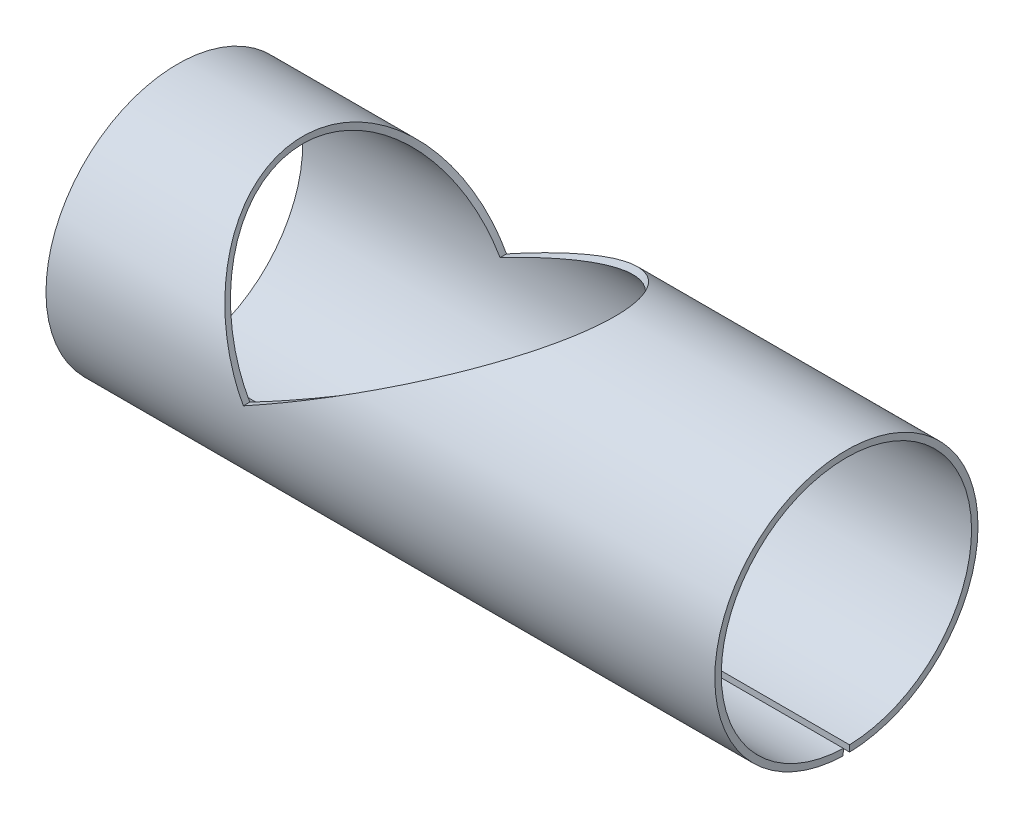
ISO-10303-21;
HEADER;
FILE_DESCRIPTION(('STEP AP214'),'2;1');
FILE_NAME('part.step','',(''),(''),'','','');
FILE_SCHEMA(('AUTOMOTIVE_DESIGN { 1 0 10303 214 1 1 1 1 }'));
ENDSEC;
DATA;
#1=APPLICATION_CONTEXT('core data for automotive mechanical design processes');
#2=APPLICATION_PROTOCOL_DEFINITION('international standard','automotive_design',2000,#1);
#3=PRODUCT_CONTEXT('',#1,'mechanical');
#4=PRODUCT('Part','Part','',(#3));
#5=PRODUCT_RELATED_PRODUCT_CATEGORY('part','',(#4));
#6=PRODUCT_DEFINITION_FORMATION('','',#4);
#7=PRODUCT_DEFINITION_CONTEXT('part definition',#1,'design');
#8=PRODUCT_DEFINITION('design','',#6,#7);
#9=PRODUCT_DEFINITION_SHAPE('','',#8);
#10=(LENGTH_UNIT() NAMED_UNIT(*) SI_UNIT(.MILLI.,.METRE.));
#11=(NAMED_UNIT(*) PLANE_ANGLE_UNIT() SI_UNIT($,.RADIAN.));
#12=(NAMED_UNIT(*) SI_UNIT($,.STERADIAN.) SOLID_ANGLE_UNIT());
#13=UNCERTAINTY_MEASURE_WITH_UNIT(LENGTH_MEASURE(1.E-05),#10,'distance_accuracy_value','');
#14=(GEOMETRIC_REPRESENTATION_CONTEXT(3) GLOBAL_UNCERTAINTY_ASSIGNED_CONTEXT((#13)) GLOBAL_UNIT_ASSIGNED_CONTEXT((#10,
#11,#12)) REPRESENTATION_CONTEXT('',''));
#15=CARTESIAN_POINT('',(0.,0.,0.));
#16=DIRECTION('',(0.,0.,1.));
#17=DIRECTION('',(1.,0.,0.));
#18=AXIS2_PLACEMENT_3D('',#15,#16,#17);
#19=CARTESIAN_POINT('',(4.96734286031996E-13,3.06567382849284E-13,-20.3683522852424));
#20=CARTESIAN_POINT('',(0.924332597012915,0.507041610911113,-20.3683522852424));
#21=CARTESIAN_POINT('',(1.76066173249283,0.966226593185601,-20.3495841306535));
#22=CARTESIAN_POINT('',(3.25741209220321,1.78749211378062,-20.2939409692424));
#23=CARTESIAN_POINT('',(3.91781681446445,2.1496044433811,-20.2570704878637));
#24=CARTESIAN_POINT('',(4.77646821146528,2.62029747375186,-20.1997227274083));
#25=CARTESIAN_POINT('',(5.04069272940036,2.76512645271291,-20.180234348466));
#26=CARTESIAN_POINT('',(5.40404058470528,2.96436865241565,-20.1515953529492));
#27=CARTESIAN_POINT('',(5.51807186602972,3.02691952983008,-20.1422815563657));
#28=CARTESIAN_POINT('',(5.74522407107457,3.15152966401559,-20.1231610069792));
#29=CARTESIAN_POINT('',(5.85809378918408,3.21345048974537,-20.113363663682));
#30=CARTESIAN_POINT('',(6.41891045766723,3.52112765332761,-20.0632407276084));
#31=CARTESIAN_POINT('',(6.85626164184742,3.76110009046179,-20.0195086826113));
#32=CARTESIAN_POINT('',(8.13440874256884,4.46236249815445,-19.8792455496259));
#33=CARTESIAN_POINT('',(8.94129820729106,4.90496767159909,-19.7736781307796));
#34=CARTESIAN_POINT('',(10.0838195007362,5.53154897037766,-19.6040445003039));
#35=CARTESIAN_POINT('',(10.4533577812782,5.7341962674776,-19.5456119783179));
#36=CARTESIAN_POINT('',(10.9907119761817,6.02891329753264,-19.4559123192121));
#37=CARTESIAN_POINT('',(11.1670053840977,6.1256125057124,-19.4256751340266));
#38=CARTESIAN_POINT('',(11.5177766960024,6.31802513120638,-19.3639495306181));
#39=CARTESIAN_POINT('',(11.6917751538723,6.41347573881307,-19.3325396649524));
#40=CARTESIAN_POINT('',(13.2452764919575,7.26570476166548,-19.0451679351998));
#41=CARTESIAN_POINT('',(14.5373858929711,7.97450529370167,-18.7565480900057));
#42=CARTESIAN_POINT('',(16.0415467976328,8.79952580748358,-18.3703922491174));
#43=CARTESIAN_POINT('',(16.3363129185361,8.96121171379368,-18.2920266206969));
#44=CARTESIAN_POINT('',(16.9174305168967,9.28000044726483,-18.1323783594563));
#45=CARTESIAN_POINT('',(17.2041004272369,9.43727195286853,-18.0509999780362));
#46=CARTESIAN_POINT('',(18.0524434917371,9.90268702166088,-17.8025355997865));
#47=CARTESIAN_POINT('',(18.6024499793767,10.2044270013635,-17.6311225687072));
#48=CARTESIAN_POINT('',(19.6713518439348,10.7907726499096,-17.2784848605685));
#49=CARTESIAN_POINT('',(20.1902472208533,11.0753787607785,-17.097260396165));
#50=CARTESIAN_POINT('',(21.1969268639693,11.6275237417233,-16.7266559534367));
#51=CARTESIAN_POINT('',(21.683742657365,11.894551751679,-16.5376671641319));
#52=CARTESIAN_POINT('',(23.1057994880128,12.6746887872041,-15.9575100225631));
#53=CARTESIAN_POINT('',(24.003315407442,13.1670816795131,-15.5527700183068));
#54=CARTESIAN_POINT('',(25.2738063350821,13.8639369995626,-14.9251048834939));
#55=CARTESIAN_POINT('',(25.6846728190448,14.0892753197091,-14.7124531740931));
#56=CARTESIAN_POINT('',(26.4811448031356,14.5261269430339,-14.2813022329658));
#57=CARTESIAN_POINT('',(26.8662439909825,14.737381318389,-14.0630928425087));
#58=CARTESIAN_POINT('',(27.9884921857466,15.3530955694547,-13.39839862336));
#59=CARTESIAN_POINT('',(28.6922565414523,15.7392425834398,-12.9419757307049));
#60=CARTESIAN_POINT('',(30.0109830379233,16.4626083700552,-12.0083728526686));
#61=CARTESIAN_POINT('',(30.6259451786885,16.7998295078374,-11.531194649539));
#62=CARTESIAN_POINT('',(31.7670672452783,17.4256971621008,-10.5616191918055));
#63=CARTESIAN_POINT('',(32.2940958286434,17.7149106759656,-10.0685104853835));
#64=CARTESIAN_POINT('',(33.7539090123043,18.515946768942,-8.56284096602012));
#65=CARTESIAN_POINT('',(34.5618402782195,18.9589332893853,-7.52708847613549));
#66=CARTESIAN_POINT('',(35.5258208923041,19.4875440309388,-5.95084127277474));
#67=CARTESIAN_POINT('',(35.8061104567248,19.6413435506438,-5.42123169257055));
#68=CARTESIAN_POINT('',(36.2871490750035,19.9052274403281,-4.3536249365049));
#69=CARTESIAN_POINT('',(36.4875390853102,20.0151266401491,-3.8161567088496));
#70=CARTESIAN_POINT('',(36.9683212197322,20.2788491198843,-2.19825833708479));
#71=CARTESIAN_POINT('',(37.1294885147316,20.367265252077,-1.10818522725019));
#72=CARTESIAN_POINT('',(37.1334338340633,20.3694193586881,1.06785923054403));
#73=CARTESIAN_POINT('',(36.9761538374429,20.283153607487,2.15816688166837));
#74=CARTESIAN_POINT('',(36.501240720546,20.0226381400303,3.77654526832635));
#75=CARTESIAN_POINT('',(36.3027701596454,19.9137983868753,4.3142607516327));
#76=CARTESIAN_POINT('',(35.8254966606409,19.6519862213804,5.38253189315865));
#77=CARTESIAN_POINT('',(35.5470415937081,19.4991855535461,5.91259020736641));
#78=CARTESIAN_POINT('',(34.5886221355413,18.9735985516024,7.49006504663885));
#79=CARTESIAN_POINT('',(33.78413049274,18.5325363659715,8.52692896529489));
#80=CARTESIAN_POINT('',(32.329075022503,17.7341173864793,10.0346533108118));
#81=CARTESIAN_POINT('',(31.8035247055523,17.4456998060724,10.5285526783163));
#82=CARTESIAN_POINT('',(30.6655449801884,16.821533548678,11.4995161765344));
#83=CARTESIAN_POINT('',(30.0520378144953,16.4851153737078,11.9774670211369));
#84=CARTESIAN_POINT('',(28.7359888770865,15.7632318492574,12.9127559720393));
#85=CARTESIAN_POINT('',(28.0334471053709,15.3777641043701,13.370092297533));
#86=CARTESIAN_POINT('',(26.9128584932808,14.762956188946,14.0362461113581));
#87=CARTESIAN_POINT('',(26.5283906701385,14.5520413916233,14.2548973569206));
#88=CARTESIAN_POINT('',(25.7331400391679,14.1158563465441,14.6869536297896));
#89=CARTESIAN_POINT('',(25.322847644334,13.8908341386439,14.9000771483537));
#90=CARTESIAN_POINT('',(24.0539692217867,13.1948695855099,15.5292105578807));
#91=CARTESIAN_POINT('',(23.1573819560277,12.7029936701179,15.9350000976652));
#92=CARTESIAN_POINT('',(21.7364985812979,11.9234941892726,16.5168152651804));
#93=CARTESIAN_POINT('',(21.2502582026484,11.6567755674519,16.7062858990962));
#94=CARTESIAN_POINT('',(20.2443957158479,11.105084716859,17.0779828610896));
#95=CARTESIAN_POINT('',(19.7257789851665,10.82063891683,17.25980184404));
#96=CARTESIAN_POINT('',(18.6571745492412,10.2344673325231,17.6137067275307));
#97=CARTESIAN_POINT('',(18.1071868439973,9.93274109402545,17.7857924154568));
#98=CARTESIAN_POINT('',(17.2586770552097,9.46722789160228,18.0353088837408));
#99=CARTESIAN_POINT('',(16.9719190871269,9.30990389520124,18.117045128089));
#100=CARTESIAN_POINT('',(16.3905604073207,8.99096930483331,18.2774206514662));
#101=CARTESIAN_POINT('',(16.0958764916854,8.82931887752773,18.3560933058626));
#102=CARTESIAN_POINT('',(14.5913570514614,8.00408492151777,18.7439732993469));
#103=CARTESIAN_POINT('',(13.297382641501,7.2943003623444,19.0343343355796));
#104=CARTESIAN_POINT('',(11.7400077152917,6.43993175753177,19.3237444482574));
#105=CARTESIAN_POINT('',(11.5655541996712,6.34422914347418,19.3553818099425));
#106=CARTESIAN_POINT('',(11.2138234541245,6.15128367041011,19.4175631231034));
#107=CARTESIAN_POINT('',(11.0370035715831,6.05429070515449,19.4480314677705));
#108=CARTESIAN_POINT('',(10.4987606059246,5.75907333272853,19.5383009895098));
#109=CARTESIAN_POINT('',(10.1283943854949,5.55597001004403,19.5971447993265));
#110=CARTESIAN_POINT('',(8.98268299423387,4.9276429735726,19.7680691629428));
#111=CARTESIAN_POINT('',(8.17272509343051,4.48336958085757,19.8745742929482));
#112=CARTESIAN_POINT('',(6.88856278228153,3.77881888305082,20.0161855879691));
#113=CARTESIAN_POINT('',(6.44897110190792,3.53761954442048,20.0603569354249));
#114=CARTESIAN_POINT('',(5.8850595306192,3.22824400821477,20.1109956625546));
#115=CARTESIAN_POINT('',(5.7715561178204,3.16597527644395,20.1208944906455));
#116=CARTESIAN_POINT('',(5.54310709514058,3.04065286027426,20.1402141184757));
#117=CARTESIAN_POINT('',(5.42898579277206,2.97804968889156,20.1495782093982));
#118=CARTESIAN_POINT('',(5.06547576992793,2.778712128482,20.1783686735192));
#119=CARTESIAN_POINT('',(4.80083288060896,2.63365294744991,20.1979890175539));
#120=CARTESIAN_POINT('',(3.93999559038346,2.16176358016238,20.2557894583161));
#121=CARTESIAN_POINT('',(3.27689256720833,1.79817855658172,20.29304111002));
#122=CARTESIAN_POINT('',(1.77226352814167,0.972595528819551,20.3493248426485));
#123=CARTESIAN_POINT('',(0.930754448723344,0.510564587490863,20.3683522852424));
#124=CARTESIAN_POINT('',(4.96734286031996E-13,0.,20.3683522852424));
#125=CARTESIAN_POINT('',(4.9960036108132E-13,2.91345885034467E-13,-19.3683522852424));
#126=CARTESIAN_POINT('',(0.924331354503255,0.482147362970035,-19.3683522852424));
#127=CARTESIAN_POINT('',(1.76066173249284,0.91878895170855,-19.3505055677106));
#128=CARTESIAN_POINT('',(3.25741209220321,1.69973380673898,-19.2975942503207));
#129=CARTESIAN_POINT('',(3.91781681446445,2.04406795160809,-19.2625339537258));
#130=CARTESIAN_POINT('',(4.77646821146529,2.49165194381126,-19.2080017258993));
#131=CARTESIAN_POINT('',(5.04069272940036,2.62937043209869,-19.1894701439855));
#132=CARTESIAN_POINT('',(5.40404058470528,2.81883068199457,-19.1622372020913));
#133=CARTESIAN_POINT('',(5.51807186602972,2.87831057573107,-19.1533806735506));
#134=CARTESIAN_POINT('',(5.74522407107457,2.99680287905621,-19.1351988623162));
#135=CARTESIAN_POINT('',(5.85809378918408,3.05568365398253,-19.1258825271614));
#136=CARTESIAN_POINT('',(6.41891045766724,3.34825516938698,-19.078220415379));
#137=CARTESIAN_POINT('',(6.85626164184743,3.57644597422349,-19.0366354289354));
#138=CARTESIAN_POINT('',(8.13440874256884,4.24327936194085,-18.9032586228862));
#139=CARTESIAN_POINT('',(8.94129820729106,4.66415449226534,-18.8028741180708));
#140=CARTESIAN_POINT('',(10.0838195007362,5.25997329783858,-18.6415687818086));
#141=CARTESIAN_POINT('',(10.4533577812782,5.45267146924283,-18.5860050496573));
#142=CARTESIAN_POINT('',(10.9907119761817,5.73291913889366,-18.5007092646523));
#143=CARTESIAN_POINT('',(11.1670053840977,5.82487082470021,-18.4719565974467));
#144=CARTESIAN_POINT('',(11.5177766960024,6.0078368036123,-18.4132614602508));
#145=CARTESIAN_POINT('',(11.6917751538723,6.09860118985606,-18.3833936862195));
#146=CARTESIAN_POINT('',(13.2452764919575,6.90898937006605,-18.110130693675));
#147=CARTESIAN_POINT('',(14.5373858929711,7.58299079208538,-17.8356808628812));
#148=CARTESIAN_POINT('',(16.0415467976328,8.36750628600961,-17.4684836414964));
#149=CARTESIAN_POINT('',(16.3363129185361,8.52125409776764,-17.3939654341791));
#150=CARTESIAN_POINT('',(16.9174305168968,8.82439165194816,-17.2421552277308));
#151=CARTESIAN_POINT('',(17.2041004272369,8.97394179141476,-17.1647721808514));
#152=CARTESIAN_POINT('',(18.0524434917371,9.41650694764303,-16.9285063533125));
#153=CARTESIAN_POINT('',(18.6024499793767,9.70343276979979,-16.7655089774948));
#154=CARTESIAN_POINT('',(19.6713518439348,10.2609913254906,-16.430184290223));
#155=CARTESIAN_POINT('',(20.1902472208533,10.5316244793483,-16.2578571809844));
#156=CARTESIAN_POINT('',(21.1969268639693,11.0566614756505,-15.9054478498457));
#157=CARTESIAN_POINT('',(21.6837426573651,11.3105795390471,-15.7257376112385));
#158=CARTESIAN_POINT('',(23.1057994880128,12.052415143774,-15.1740637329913));
#159=CARTESIAN_POINT('',(24.003315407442,12.5206336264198,-14.7891947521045));
#160=CARTESIAN_POINT('',(25.2738063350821,13.1832762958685,-14.1923453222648));
#161=CARTESIAN_POINT('',(25.6846728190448,13.3975514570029,-13.990133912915));
#162=CARTESIAN_POINT('',(26.4811448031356,13.8129555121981,-13.5801506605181));
#163=CARTESIAN_POINT('',(26.8662439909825,14.0138381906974,-13.3726544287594));
#164=CARTESIAN_POINT('',(27.9884921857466,14.5993234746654,-12.7405938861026));
#165=CARTESIAN_POINT('',(28.6922565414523,14.9665123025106,-12.3065794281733));
#166=CARTESIAN_POINT('',(30.0109830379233,15.6543638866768,-11.4188125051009));
#167=CARTESIAN_POINT('',(30.6259451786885,15.9750288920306,-10.9650617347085));
#168=CARTESIAN_POINT('',(31.7670672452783,16.5701690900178,-10.0430883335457));
#169=CARTESIAN_POINT('',(32.2940958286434,16.8451834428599,-9.57418918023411));
#170=CARTESIAN_POINT('',(33.7539090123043,17.6068920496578,-8.14244166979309));
#171=CARTESIAN_POINT('',(34.5618402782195,18.0281298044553,-7.15754024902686));
#172=CARTESIAN_POINT('',(35.5258208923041,18.5307879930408,-5.65868012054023));
#173=CARTESIAN_POINT('',(35.8061104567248,18.6770366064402,-5.15507213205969));
#174=CARTESIAN_POINT('',(36.2871490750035,18.9279649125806,-4.13988035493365));
#175=CARTESIAN_POINT('',(36.4875390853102,19.0324685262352,-3.62879954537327));
#176=CARTESIAN_POINT('',(36.9683212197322,19.2832433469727,-2.09033314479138));
#177=CARTESIAN_POINT('',(37.1294885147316,19.3673186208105,-1.05377801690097));
#178=CARTESIAN_POINT('',(37.1334338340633,19.3693669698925,1.01543185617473));
#179=CARTESIAN_POINT('',(36.9761538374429,19.2873365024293,2.05221001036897));
#180=CARTESIAN_POINT('',(36.501240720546,19.0396112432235,3.59113285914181));
#181=CARTESIAN_POINT('',(36.3027701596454,18.9361150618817,4.10244878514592));
#182=CARTESIAN_POINT('',(35.8254966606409,18.6871567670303,5.11827232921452));
#183=CARTESIAN_POINT('',(35.5470415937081,18.5418579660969,5.62230702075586));
#184=CARTESIAN_POINT('',(34.5886221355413,18.0420750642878,7.12233451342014));
#185=CARTESIAN_POINT('',(33.78413049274,17.6226671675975,8.10829279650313));
#186=CARTESIAN_POINT('',(32.329075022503,16.8634471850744,9.54199424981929));
#187=CARTESIAN_POINT('',(31.8035247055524,16.5891896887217,10.0116452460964));
#188=CARTESIAN_POINT('',(30.6655449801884,15.9956673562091,10.9349385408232));
#189=CARTESIAN_POINT('',(30.0520378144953,15.6757658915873,11.3894240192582));
#190=CARTESIAN_POINT('',(28.7359888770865,14.9893237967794,12.2787942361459));
#191=CARTESIAN_POINT('',(28.0334471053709,14.6227808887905,12.7136772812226));
#192=CARTESIAN_POINT('',(26.9128584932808,14.0381574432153,13.347125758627));
#193=CARTESIAN_POINT('',(26.5283906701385,13.8375976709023,13.5550421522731));
#194=CARTESIAN_POINT('',(25.7331400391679,13.4228274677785,13.9658862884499));
#195=CARTESIAN_POINT('',(25.322847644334,13.2088528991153,14.1685463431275));
#196=CARTESIAN_POINT('',(24.0539692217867,12.5470572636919,14.7667919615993));
#197=CARTESIAN_POINT('',(23.1573819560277,12.0793303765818,15.1526589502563));
#198=CARTESIAN_POINT('',(21.7364985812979,11.3381010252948,15.7059094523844));
#199=CARTESIAN_POINT('',(21.2502582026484,11.0844771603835,15.886077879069));
#200=CARTESIAN_POINT('',(20.2443957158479,10.5598719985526,16.2395260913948));
#201=CARTESIAN_POINT('',(19.7257789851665,10.2893912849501,16.4124185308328));
#202=CARTESIAN_POINT('',(18.6571745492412,9.73199824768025,16.7489481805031));
#203=CARTESIAN_POINT('',(18.1071868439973,9.44508549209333,16.9125851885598));
#204=CARTESIAN_POINT('',(17.2586770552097,9.00242702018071,17.1498514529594));
#205=CARTESIAN_POINT('',(16.9719190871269,8.85282696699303,17.22757479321));
#206=CARTESIAN_POINT('',(16.3905604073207,8.54955071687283,17.3800765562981));
#207=CARTESIAN_POINT('',(16.0958764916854,8.39583664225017,17.4548867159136));
#208=CARTESIAN_POINT('',(14.5913570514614,7.61111818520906,17.82372344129));
#209=CARTESIAN_POINT('',(13.297382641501,6.93618104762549,18.0998289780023));
#210=CARTESIAN_POINT('',(11.7400077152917,6.1237583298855,18.3750302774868));
#211=CARTESIAN_POINT('',(11.5655541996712,6.03275430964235,18.4051143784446));
#212=CARTESIAN_POINT('',(11.2138234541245,5.84928164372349,18.4642428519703));
#213=CARTESIAN_POINT('',(11.0370035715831,5.75705062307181,18.4932153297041));
#214=CARTESIAN_POINT('',(10.4987606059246,5.47632717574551,18.5790529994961));
#215=CARTESIAN_POINT('',(10.1283943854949,5.28319536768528,18.6350078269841));
#216=CARTESIAN_POINT('',(8.98268299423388,4.68571653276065,18.7975405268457));
#217=CARTESIAN_POINT('',(8.17272509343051,4.26325508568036,18.8988167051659));
#218=CARTESIAN_POINT('',(6.88856278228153,3.5932948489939,19.0334754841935));
#219=CARTESIAN_POINT('',(6.44897110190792,3.36393737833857,19.0754782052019));
#220=CARTESIAN_POINT('',(5.88505953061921,3.06975087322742,19.1236307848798));
#221=CARTESIAN_POINT('',(5.7715561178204,3.01053927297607,19.1330436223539));
#222=CARTESIAN_POINT('',(5.54310709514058,2.89136965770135,19.1514147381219));
#223=CARTESIAN_POINT('',(5.42898579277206,2.83184003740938,19.1603190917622));
#224=CARTESIAN_POINT('',(5.06547576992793,2.6422891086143,19.1876960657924));
#225=CARTESIAN_POINT('',(4.80083288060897,2.50435172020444,19.2063531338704));
#226=CARTESIAN_POINT('',(3.93999559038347,2.05563012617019,19.2613158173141));
#227=CARTESIAN_POINT('',(3.27689256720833,1.70989559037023,19.2967385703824));
#228=CARTESIAN_POINT('',(1.77226352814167,0.92484519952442,19.3502590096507));
#229=CARTESIAN_POINT('',(0.930753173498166,0.485497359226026,19.3683522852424));
#230=CARTESIAN_POINT('',(4.9960036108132E-13,0.,19.3683522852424));
#231=B_SPLINE_SURFACE_WITH_KNOTS('',1,3,((#19,#20,#21,#22,#23,#24,#25,#26,#27,#28,#29,#30,#31,
#32,#33,#34,#35,#36,#37,#38,#39,#40,#41,#42,#43,#44,#45,#46,#47,#48,#49,#50,#51,#52,#53,#54,#55,
#56,#57,#58,#59,#60,#61,#62,#63,#64,#65,#66,#67,#68,#69,#70,#71,#72,#73,#74,#75,#76,#77,#78,#79,
#80,#81,#82,#83,#84,#85,#86,#87,#88,#89,#90,#91,#92,#93,#94,#95,#96,#97,#98,#99,#100,#101,#102,
#103,#104,#105,#106,#107,#108,#109,#110,#111,#112,#113,#114,#115,#116,#117,#118,#119,#120,#121,
#122,#123,#124),(#125,#126,#127,#128,#129,#130,#131,#132,#133,#134,#135,#136,#137,#138,#139,
#140,#141,#142,#143,#144,#145,#146,#147,#148,#149,#150,#151,#152,#153,#154,#155,#156,#157,#158,
#159,#160,#161,#162,#163,#164,#165,#166,#167,#168,#169,#170,#171,#172,#173,#174,#175,#176,#177,
#178,#179,#180,#181,#182,#183,#184,#185,#186,#187,#188,#189,#190,#191,#192,#193,#194,#195,#196,
#197,#198,#199,#200,#201,#202,#203,#204,#205,#206,#207,#208,#209,#210,#211,#212,#213,#214,#215,
#216,#217,#218,#219,#220,#221,#222,#223,#224,#225,#226,#227,#228,#229,#230)),.UNSPECIFIED.,.F.,
.F.,.F.,(2,2),(4,2,2,2,2,2,2,2,2,2,2,2,2,2,2,2,2,2,2,2,2,2,2,2,2,2,2,2,2,2,2,2,2,2,2,2,2,2,2,2,
2,2,2,2,2,2,2,2,2,2,2,2,4),(0.,1.),(0.,0.0078125,0.015625,0.01953125,0.021484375,0.0234375,
0.03125,0.046875,0.0546875,0.05859375,0.0625,0.09375,0.1015625,0.109375,0.125,0.140625,0.15625,
0.1875,0.203125,0.21875,0.25,0.28125,0.3125,0.375,0.40625,0.4375,0.5,0.5625,0.59375,0.625,
0.6875,0.71875,0.75,0.78125,0.796875,0.8125,0.84375,0.859375,0.875,0.890625,0.8984375,0.90625,
0.9375,0.94140625,0.9453125,0.953125,0.96875,0.9765625,0.978515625,0.98046875,0.984375,
0.9921875,1.),.UNSPECIFIED.);
#232=CARTESIAN_POINT('',(4.9960036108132E-13,2.91345885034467E-13,-19.3683522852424));
#233=CARTESIAN_POINT('',(4.96734286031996E-13,3.06567382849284E-13,-20.3683522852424));
#234=B_SPLINE_CURVE_WITH_KNOTS('',1,(#232,#233),.UNSPECIFIED.,.F.,.F.,(2,2),(0.,1.),.UNSPECIFIED.);
#235=CARTESIAN_POINT('',(4.9960036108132E-13,2.91345885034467E-13,-19.3683522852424));
#236=VERTEX_POINT('',#235);
#237=CARTESIAN_POINT('',(3.84372866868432E-07,2.10847359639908E-07,-20.3683522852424));
#238=VERTEX_POINT('',#237);
#239=EDGE_CURVE('E13',#236,#238,#234,.T.);
#240=CARTESIAN_POINT('',(4.9960036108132E-13,2.91345885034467E-13,-19.3683522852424));
#241=CARTESIAN_POINT('',(0.924331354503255,0.482147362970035,-19.3683522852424));
#242=CARTESIAN_POINT('',(1.76066173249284,0.91878895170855,-19.3505055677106));
#243=CARTESIAN_POINT('',(3.25741209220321,1.69973380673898,-19.2975942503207));
#244=CARTESIAN_POINT('',(3.91781681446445,2.04406795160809,-19.2625339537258));
#245=CARTESIAN_POINT('',(4.77646821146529,2.49165194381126,-19.2080017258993));
#246=CARTESIAN_POINT('',(5.04069272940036,2.62937043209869,-19.1894701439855));
#247=CARTESIAN_POINT('',(5.40404058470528,2.81883068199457,-19.1622372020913));
#248=CARTESIAN_POINT('',(5.51807186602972,2.87831057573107,-19.1533806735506));
#249=CARTESIAN_POINT('',(5.74522407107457,2.99680287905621,-19.1351988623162));
#250=CARTESIAN_POINT('',(5.85809378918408,3.05568365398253,-19.1258825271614));
#251=CARTESIAN_POINT('',(6.41891045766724,3.34825516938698,-19.078220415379));
#252=CARTESIAN_POINT('',(6.85626164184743,3.57644597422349,-19.0366354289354));
#253=CARTESIAN_POINT('',(8.13440874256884,4.24327936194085,-18.9032586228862));
#254=CARTESIAN_POINT('',(8.94129820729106,4.66415449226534,-18.8028741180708));
#255=CARTESIAN_POINT('',(10.0838195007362,5.25997329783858,-18.6415687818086));
#256=CARTESIAN_POINT('',(10.4533577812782,5.45267146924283,-18.5860050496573));
#257=CARTESIAN_POINT('',(10.9907119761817,5.73291913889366,-18.5007092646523));
#258=CARTESIAN_POINT('',(11.1670053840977,5.82487082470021,-18.4719565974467));
#259=CARTESIAN_POINT('',(11.5177766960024,6.0078368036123,-18.4132614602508));
#260=CARTESIAN_POINT('',(11.6917751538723,6.09860118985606,-18.3833936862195));
#261=CARTESIAN_POINT('',(13.2452764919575,6.90898937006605,-18.110130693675));
#262=CARTESIAN_POINT('',(14.5373858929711,7.58299079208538,-17.8356808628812));
#263=CARTESIAN_POINT('',(16.0415467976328,8.36750628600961,-17.4684836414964));
#264=CARTESIAN_POINT('',(16.3363129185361,8.52125409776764,-17.3939654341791));
#265=CARTESIAN_POINT('',(16.9174305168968,8.82439165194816,-17.2421552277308));
#266=CARTESIAN_POINT('',(17.2041004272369,8.97394179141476,-17.1647721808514));
#267=CARTESIAN_POINT('',(18.0524434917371,9.41650694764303,-16.9285063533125));
#268=CARTESIAN_POINT('',(18.6024499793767,9.70343276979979,-16.7655089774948));
#269=CARTESIAN_POINT('',(19.6713518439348,10.2609913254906,-16.430184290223));
#270=CARTESIAN_POINT('',(20.1902472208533,10.5316244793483,-16.2578571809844));
#271=CARTESIAN_POINT('',(21.1969268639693,11.0566614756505,-15.9054478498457));
#272=CARTESIAN_POINT('',(21.6837426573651,11.3105795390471,-15.7257376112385));
#273=CARTESIAN_POINT('',(23.1057994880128,12.052415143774,-15.1740637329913));
#274=CARTESIAN_POINT('',(24.003315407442,12.5206336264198,-14.7891947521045));
#275=CARTESIAN_POINT('',(25.2738063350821,13.1832762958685,-14.1923453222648));
#276=CARTESIAN_POINT('',(25.6846728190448,13.3975514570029,-13.990133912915));
#277=CARTESIAN_POINT('',(26.4811448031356,13.8129555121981,-13.5801506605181));
#278=CARTESIAN_POINT('',(26.8662439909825,14.0138381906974,-13.3726544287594));
#279=CARTESIAN_POINT('',(27.9884921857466,14.5993234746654,-12.7405938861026));
#280=CARTESIAN_POINT('',(28.6922565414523,14.9665123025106,-12.3065794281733));
#281=CARTESIAN_POINT('',(30.0109830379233,15.6543638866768,-11.4188125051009));
#282=CARTESIAN_POINT('',(30.6259451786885,15.9750288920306,-10.9650617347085));
#283=CARTESIAN_POINT('',(31.7670672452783,16.5701690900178,-10.0430883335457));
#284=CARTESIAN_POINT('',(32.2940958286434,16.8451834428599,-9.57418918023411));
#285=CARTESIAN_POINT('',(33.7539090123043,17.6068920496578,-8.14244166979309));
#286=CARTESIAN_POINT('',(34.5618402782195,18.0281298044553,-7.15754024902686));
#287=CARTESIAN_POINT('',(35.5258208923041,18.5307879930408,-5.65868012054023));
#288=CARTESIAN_POINT('',(35.8061104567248,18.6770366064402,-5.15507213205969));
#289=CARTESIAN_POINT('',(36.2871490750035,18.9279649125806,-4.13988035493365));
#290=CARTESIAN_POINT('',(36.4875390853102,19.0324685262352,-3.62879954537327));
#291=CARTESIAN_POINT('',(36.9683212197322,19.2832433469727,-2.09033314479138));
#292=CARTESIAN_POINT('',(37.1294885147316,19.3673186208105,-1.05377801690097));
#293=CARTESIAN_POINT('',(37.1334338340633,19.3693669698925,1.01543185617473));
#294=CARTESIAN_POINT('',(36.9761538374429,19.2873365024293,2.05221001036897));
#295=CARTESIAN_POINT('',(36.501240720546,19.0396112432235,3.59113285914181));
#296=CARTESIAN_POINT('',(36.3027701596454,18.9361150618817,4.10244878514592));
#297=CARTESIAN_POINT('',(35.8254966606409,18.6871567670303,5.11827232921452));
#298=CARTESIAN_POINT('',(35.5470415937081,18.5418579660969,5.62230702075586));
#299=CARTESIAN_POINT('',(34.5886221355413,18.0420750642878,7.12233451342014));
#300=CARTESIAN_POINT('',(33.78413049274,17.6226671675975,8.10829279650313));
#301=CARTESIAN_POINT('',(32.329075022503,16.8634471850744,9.54199424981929));
#302=CARTESIAN_POINT('',(31.8035247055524,16.5891896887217,10.0116452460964));
#303=CARTESIAN_POINT('',(30.6655449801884,15.9956673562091,10.9349385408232));
#304=CARTESIAN_POINT('',(30.0520378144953,15.6757658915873,11.3894240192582));
#305=CARTESIAN_POINT('',(28.7359888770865,14.9893237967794,12.2787942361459));
#306=CARTESIAN_POINT('',(28.0334471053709,14.6227808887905,12.7136772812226));
#307=CARTESIAN_POINT('',(26.9128584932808,14.0381574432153,13.347125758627));
#308=CARTESIAN_POINT('',(26.5283906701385,13.8375976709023,13.5550421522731));
#309=CARTESIAN_POINT('',(25.7331400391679,13.4228274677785,13.9658862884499));
#310=CARTESIAN_POINT('',(25.322847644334,13.2088528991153,14.1685463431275));
#311=CARTESIAN_POINT('',(24.0539692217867,12.5470572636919,14.7667919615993));
#312=CARTESIAN_POINT('',(23.1573819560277,12.0793303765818,15.1526589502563));
#313=CARTESIAN_POINT('',(21.7364985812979,11.3381010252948,15.7059094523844));
#314=CARTESIAN_POINT('',(21.2502582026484,11.0844771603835,15.886077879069));
#315=CARTESIAN_POINT('',(20.2443957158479,10.5598719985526,16.2395260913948));
#316=CARTESIAN_POINT('',(19.7257789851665,10.2893912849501,16.4124185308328));
#317=CARTESIAN_POINT('',(18.6571745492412,9.73199824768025,16.7489481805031));
#318=CARTESIAN_POINT('',(18.1071868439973,9.44508549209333,16.9125851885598));
#319=CARTESIAN_POINT('',(17.2586770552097,9.00242702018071,17.1498514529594));
#320=CARTESIAN_POINT('',(16.9719190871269,8.85282696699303,17.22757479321));
#321=CARTESIAN_POINT('',(16.3905604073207,8.54955071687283,17.3800765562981));
#322=CARTESIAN_POINT('',(16.0958764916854,8.39583664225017,17.4548867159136));
#323=CARTESIAN_POINT('',(14.5913570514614,7.61111818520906,17.82372344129));
#324=CARTESIAN_POINT('',(13.297382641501,6.93618104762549,18.0998289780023));
#325=CARTESIAN_POINT('',(11.7400077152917,6.1237583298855,18.3750302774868));
#326=CARTESIAN_POINT('',(11.5655541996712,6.03275430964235,18.4051143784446));
#327=CARTESIAN_POINT('',(11.2138234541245,5.84928164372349,18.4642428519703));
#328=CARTESIAN_POINT('',(11.0370035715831,5.75705062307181,18.4932153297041));
#329=CARTESIAN_POINT('',(10.4987606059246,5.47632717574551,18.5790529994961));
#330=CARTESIAN_POINT('',(10.1283943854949,5.28319536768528,18.6350078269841));
#331=CARTESIAN_POINT('',(8.98268299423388,4.68571653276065,18.7975405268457));
#332=CARTESIAN_POINT('',(8.17272509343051,4.26325508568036,18.8988167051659));
#333=CARTESIAN_POINT('',(6.88856278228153,3.5932948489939,19.0334754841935));
#334=CARTESIAN_POINT('',(6.44897110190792,3.36393737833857,19.0754782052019));
#335=CARTESIAN_POINT('',(5.88505953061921,3.06975087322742,19.1236307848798));
#336=CARTESIAN_POINT('',(5.7715561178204,3.01053927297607,19.1330436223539));
#337=CARTESIAN_POINT('',(5.54310709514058,2.89136965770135,19.1514147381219));
#338=CARTESIAN_POINT('',(5.42898579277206,2.83184003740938,19.1603190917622));
#339=CARTESIAN_POINT('',(5.06547576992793,2.6422891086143,19.1876960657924));
#340=CARTESIAN_POINT('',(4.80083288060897,2.50435172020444,19.2063531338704));
#341=CARTESIAN_POINT('',(3.93999559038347,2.05563012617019,19.2613158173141));
#342=CARTESIAN_POINT('',(3.27689256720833,1.70989559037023,19.2967385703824));
#343=CARTESIAN_POINT('',(1.77226352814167,0.92484519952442,19.3502590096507));
#344=CARTESIAN_POINT('',(0.930753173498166,0.485497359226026,19.3683522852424));
#345=CARTESIAN_POINT('',(4.9960036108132E-13,0.,19.3683522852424));
#346=B_SPLINE_CURVE_WITH_KNOTS('',3,(#240,#241,#242,#243,#244,#245,#246,#247,#248,#249,#250,
#251,#252,#253,#254,#255,#256,#257,#258,#259,#260,#261,#262,#263,#264,#265,#266,#267,#268,#269,
#270,#271,#272,#273,#274,#275,#276,#277,#278,#279,#280,#281,#282,#283,#284,#285,#286,#287,#288,
#289,#290,#291,#292,#293,#294,#295,#296,#297,#298,#299,#300,#301,#302,#303,#304,#305,#306,#307,
#308,#309,#310,#311,#312,#313,#314,#315,#316,#317,#318,#319,#320,#321,#322,#323,#324,#325,#326,
#327,#328,#329,#330,#331,#332,#333,#334,#335,#336,#337,#338,#339,#340,#341,#342,#343,#344,#345),
.UNSPECIFIED.,.F.,.F.,(4,2,2,2,2,2,2,2,2,2,2,2,2,2,2,2,2,2,2,2,2,2,2,2,2,2,2,2,2,2,2,2,2,2,2,2,
2,2,2,2,2,2,2,2,2,2,2,2,2,2,2,2,4),(0.,0.0078125,0.015625,0.01953125,0.021484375,0.0234375,
0.03125,0.046875,0.0546875,0.05859375,0.0625,0.09375,0.1015625,0.109375,0.125,0.140625,0.15625,
0.1875,0.203125,0.21875,0.25,0.28125,0.3125,0.375,0.40625,0.4375,0.5,0.5625,0.59375,0.625,
0.6875,0.71875,0.75,0.78125,0.796875,0.8125,0.84375,0.859375,0.875,0.890625,0.8984375,0.90625,
0.9375,0.94140625,0.9453125,0.953125,0.96875,0.9765625,0.978515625,0.98046875,0.984375,
0.9921875,1.),.UNSPECIFIED.);
#347=CARTESIAN_POINT('',(4.9960036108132E-13,0.,19.3683522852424));
#348=VERTEX_POINT('',#347);
#349=EDGE_CURVE('E250',#236,#348,#346,.T.);
#350=CARTESIAN_POINT('',(4.9960036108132E-13,0.,19.3683522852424));
#351=CARTESIAN_POINT('',(4.96734286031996E-13,0.,20.3683522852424));
#352=B_SPLINE_CURVE_WITH_KNOTS('',1,(#350,#351),.UNSPECIFIED.,.F.,.F.,(2,2),(0.,1.),.UNSPECIFIED.);
#353=CARTESIAN_POINT('',(3.84372866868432E-07,2.10847145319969E-07,20.3683522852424));
#354=VERTEX_POINT('',#353);
#355=EDGE_CURVE('E53',#348,#354,#352,.T.);
#356=CARTESIAN_POINT('',(4.96734286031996E-13,0.,20.3683522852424));
#357=CARTESIAN_POINT('',(0.930754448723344,0.510564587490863,20.3683522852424));
#358=CARTESIAN_POINT('',(1.77226352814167,0.972595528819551,20.3493248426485));
#359=CARTESIAN_POINT('',(3.27689256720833,1.79817855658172,20.29304111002));
#360=CARTESIAN_POINT('',(3.93999559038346,2.16176358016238,20.2557894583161));
#361=CARTESIAN_POINT('',(4.80083288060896,2.63365294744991,20.1979890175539));
#362=CARTESIAN_POINT('',(5.06547576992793,2.778712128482,20.1783686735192));
#363=CARTESIAN_POINT('',(5.42898579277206,2.97804968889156,20.1495782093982));
#364=CARTESIAN_POINT('',(5.54310709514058,3.04065286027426,20.1402141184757));
#365=CARTESIAN_POINT('',(5.7715561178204,3.16597527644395,20.1208944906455));
#366=CARTESIAN_POINT('',(5.8850595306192,3.22824400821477,20.1109956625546));
#367=CARTESIAN_POINT('',(6.44897110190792,3.53761954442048,20.0603569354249));
#368=CARTESIAN_POINT('',(6.88856278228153,3.77881888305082,20.0161855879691));
#369=CARTESIAN_POINT('',(8.17272509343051,4.48336958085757,19.8745742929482));
#370=CARTESIAN_POINT('',(8.98268299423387,4.9276429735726,19.7680691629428));
#371=CARTESIAN_POINT('',(10.1283943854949,5.55597001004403,19.5971447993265));
#372=CARTESIAN_POINT('',(10.4987606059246,5.75907333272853,19.5383009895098));
#373=CARTESIAN_POINT('',(11.0370035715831,6.05429070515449,19.4480314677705));
#374=CARTESIAN_POINT('',(11.2138234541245,6.15128367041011,19.4175631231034));
#375=CARTESIAN_POINT('',(11.5655541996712,6.34422914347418,19.3553818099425));
#376=CARTESIAN_POINT('',(11.7400077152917,6.43993175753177,19.3237444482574));
#377=CARTESIAN_POINT('',(13.297382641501,7.2943003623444,19.0343343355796));
#378=CARTESIAN_POINT('',(14.5913570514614,8.00408492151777,18.7439732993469));
#379=CARTESIAN_POINT('',(16.0958764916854,8.82931887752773,18.3560933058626));
#380=CARTESIAN_POINT('',(16.3905604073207,8.99096930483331,18.2774206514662));
#381=CARTESIAN_POINT('',(16.9719190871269,9.30990389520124,18.117045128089));
#382=CARTESIAN_POINT('',(17.2586770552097,9.46722789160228,18.0353088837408));
#383=CARTESIAN_POINT('',(18.1071868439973,9.93274109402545,17.7857924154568));
#384=CARTESIAN_POINT('',(18.6571745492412,10.2344673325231,17.6137067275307));
#385=CARTESIAN_POINT('',(19.7257789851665,10.82063891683,17.25980184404));
#386=CARTESIAN_POINT('',(20.2443957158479,11.105084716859,17.0779828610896));
#387=CARTESIAN_POINT('',(21.2502582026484,11.6567755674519,16.7062858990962));
#388=CARTESIAN_POINT('',(21.7364985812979,11.9234941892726,16.5168152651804));
#389=CARTESIAN_POINT('',(23.1573819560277,12.7029936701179,15.9350000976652));
#390=CARTESIAN_POINT('',(24.0539692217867,13.1948695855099,15.5292105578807));
#391=CARTESIAN_POINT('',(25.322847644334,13.8908341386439,14.9000771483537));
#392=CARTESIAN_POINT('',(25.7331400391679,14.1158563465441,14.6869536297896));
#393=CARTESIAN_POINT('',(26.5283906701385,14.5520413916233,14.2548973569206));
#394=CARTESIAN_POINT('',(26.9128584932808,14.762956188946,14.0362461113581));
#395=CARTESIAN_POINT('',(28.0334471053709,15.3777641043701,13.370092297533));
#396=CARTESIAN_POINT('',(28.7359888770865,15.7632318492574,12.9127559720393));
#397=CARTESIAN_POINT('',(30.0520378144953,16.4851153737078,11.9774670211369));
#398=CARTESIAN_POINT('',(30.6655449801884,16.821533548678,11.4995161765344));
#399=CARTESIAN_POINT('',(31.8035247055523,17.4456998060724,10.5285526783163));
#400=CARTESIAN_POINT('',(32.329075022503,17.7341173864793,10.0346533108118));
#401=CARTESIAN_POINT('',(33.78413049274,18.5325363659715,8.52692896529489));
#402=CARTESIAN_POINT('',(34.5886221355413,18.9735985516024,7.49006504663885));
#403=CARTESIAN_POINT('',(35.5470415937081,19.4991855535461,5.91259020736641));
#404=CARTESIAN_POINT('',(35.8254966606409,19.6519862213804,5.38253189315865));
#405=CARTESIAN_POINT('',(36.3027701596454,19.9137983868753,4.3142607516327));
#406=CARTESIAN_POINT('',(36.501240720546,20.0226381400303,3.77654526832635));
#407=CARTESIAN_POINT('',(36.9761538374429,20.283153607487,2.15816688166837));
#408=CARTESIAN_POINT('',(37.1334338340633,20.3694193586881,1.06785923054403));
#409=CARTESIAN_POINT('',(37.1294885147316,20.367265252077,-1.10818522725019));
#410=CARTESIAN_POINT('',(36.9683212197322,20.2788491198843,-2.19825833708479));
#411=CARTESIAN_POINT('',(36.4875390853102,20.0151266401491,-3.8161567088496));
#412=CARTESIAN_POINT('',(36.2871490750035,19.9052274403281,-4.3536249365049));
#413=CARTESIAN_POINT('',(35.8061104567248,19.6413435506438,-5.42123169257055));
#414=CARTESIAN_POINT('',(35.5258208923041,19.4875440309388,-5.95084127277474));
#415=CARTESIAN_POINT('',(34.5618402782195,18.9589332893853,-7.52708847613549));
#416=CARTESIAN_POINT('',(33.7539090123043,18.515946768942,-8.56284096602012));
#417=CARTESIAN_POINT('',(32.2940958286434,17.7149106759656,-10.0685104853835));
#418=CARTESIAN_POINT('',(31.7670672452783,17.4256971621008,-10.5616191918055));
#419=CARTESIAN_POINT('',(30.6259451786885,16.7998295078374,-11.531194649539));
#420=CARTESIAN_POINT('',(30.0109830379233,16.4626083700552,-12.0083728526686));
#421=CARTESIAN_POINT('',(28.6922565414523,15.7392425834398,-12.9419757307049));
#422=CARTESIAN_POINT('',(27.9884921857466,15.3530955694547,-13.39839862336));
#423=CARTESIAN_POINT('',(26.8662439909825,14.737381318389,-14.0630928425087));
#424=CARTESIAN_POINT('',(26.4811448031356,14.5261269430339,-14.2813022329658));
#425=CARTESIAN_POINT('',(25.6846728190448,14.0892753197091,-14.7124531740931));
#426=CARTESIAN_POINT('',(25.2738063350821,13.8639369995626,-14.9251048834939));
#427=CARTESIAN_POINT('',(24.003315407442,13.1670816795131,-15.5527700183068));
#428=CARTESIAN_POINT('',(23.1057994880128,12.6746887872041,-15.9575100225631));
#429=CARTESIAN_POINT('',(21.683742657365,11.894551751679,-16.5376671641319));
#430=CARTESIAN_POINT('',(21.1969268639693,11.6275237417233,-16.7266559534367));
#431=CARTESIAN_POINT('',(20.1902472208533,11.0753787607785,-17.097260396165));
#432=CARTESIAN_POINT('',(19.6713518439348,10.7907726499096,-17.2784848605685));
#433=CARTESIAN_POINT('',(18.6024499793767,10.2044270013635,-17.6311225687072));
#434=CARTESIAN_POINT('',(18.0524434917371,9.90268702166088,-17.8025355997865));
#435=CARTESIAN_POINT('',(17.2041004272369,9.43727195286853,-18.0509999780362));
#436=CARTESIAN_POINT('',(16.9174305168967,9.28000044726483,-18.1323783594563));
#437=CARTESIAN_POINT('',(16.3363129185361,8.96121171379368,-18.2920266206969));
#438=CARTESIAN_POINT('',(16.0415467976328,8.79952580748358,-18.3703922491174));
#439=CARTESIAN_POINT('',(14.5373858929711,7.97450529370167,-18.7565480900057));
#440=CARTESIAN_POINT('',(13.2452764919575,7.26570476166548,-19.0451679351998));
#441=CARTESIAN_POINT('',(11.6917751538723,6.41347573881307,-19.3325396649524));
#442=CARTESIAN_POINT('',(11.5177766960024,6.31802513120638,-19.3639495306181));
#443=CARTESIAN_POINT('',(11.1670053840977,6.1256125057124,-19.4256751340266));
#444=CARTESIAN_POINT('',(10.9907119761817,6.02891329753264,-19.4559123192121));
#445=CARTESIAN_POINT('',(10.4533577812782,5.7341962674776,-19.5456119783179));
#446=CARTESIAN_POINT('',(10.0838195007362,5.53154897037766,-19.6040445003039));
#447=CARTESIAN_POINT('',(8.94129820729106,4.90496767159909,-19.7736781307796));
#448=CARTESIAN_POINT('',(8.13440874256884,4.46236249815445,-19.8792455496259));
#449=CARTESIAN_POINT('',(6.85626164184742,3.76110009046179,-20.0195086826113));
#450=CARTESIAN_POINT('',(6.41891045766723,3.52112765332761,-20.0632407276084));
#451=CARTESIAN_POINT('',(5.85809378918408,3.21345048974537,-20.113363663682));
#452=CARTESIAN_POINT('',(5.74522407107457,3.15152966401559,-20.1231610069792));
#453=CARTESIAN_POINT('',(5.51807186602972,3.02691952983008,-20.1422815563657));
#454=CARTESIAN_POINT('',(5.40404058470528,2.96436865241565,-20.1515953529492));
#455=CARTESIAN_POINT('',(5.04069272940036,2.76512645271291,-20.180234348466));
#456=CARTESIAN_POINT('',(4.77646821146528,2.62029747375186,-20.1997227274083));
#457=CARTESIAN_POINT('',(3.91781681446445,2.1496044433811,-20.2570704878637));
#458=CARTESIAN_POINT('',(3.25741209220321,1.78749211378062,-20.2939409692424));
#459=CARTESIAN_POINT('',(1.76066173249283,0.966226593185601,-20.3495841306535));
#460=CARTESIAN_POINT('',(0.924332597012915,0.507041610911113,-20.3683522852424));
#461=CARTESIAN_POINT('',(4.96734286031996E-13,3.06567382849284E-13,-20.3683522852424));
#462=B_SPLINE_CURVE_WITH_KNOTS('',3,(#356,#357,#358,#359,#360,#361,#362,#363,#364,#365,#366,
#367,#368,#369,#370,#371,#372,#373,#374,#375,#376,#377,#378,#379,#380,#381,#382,#383,#384,#385,
#386,#387,#388,#389,#390,#391,#392,#393,#394,#395,#396,#397,#398,#399,#400,#401,#402,#403,#404,
#405,#406,#407,#408,#409,#410,#411,#412,#413,#414,#415,#416,#417,#418,#419,#420,#421,#422,#423,
#424,#425,#426,#427,#428,#429,#430,#431,#432,#433,#434,#435,#436,#437,#438,#439,#440,#441,#442,
#443,#444,#445,#446,#447,#448,#449,#450,#451,#452,#453,#454,#455,#456,#457,#458,#459,#460,#461),
.UNSPECIFIED.,.F.,.F.,(4,2,2,2,2,2,2,2,2,2,2,2,2,2,2,2,2,2,2,2,2,2,2,2,2,2,2,2,2,2,2,2,2,2,2,2,
2,2,2,2,2,2,2,2,2,2,2,2,2,2,2,2,4),(0.,0.0078125,0.015625,0.01953125,0.021484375,0.0234375,
0.03125,0.046875,0.0546875,0.05859375,0.0625,0.09375,0.1015625,0.109375,0.125,0.140625,0.15625,
0.1875,0.203125,0.21875,0.25,0.28125,0.3125,0.375,0.40625,0.4375,0.5,0.5625,0.59375,0.625,
0.6875,0.71875,0.75,0.78125,0.796875,0.8125,0.84375,0.859375,0.875,0.890625,0.8984375,0.90625,
0.9375,0.94140625,0.9453125,0.953125,0.96875,0.9765625,0.978515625,0.98046875,0.984375,
0.9921875,1.),.UNSPECIFIED.);
#463=EDGE_CURVE('E126',#238,#354,#462,.F.);
#464=ORIENTED_EDGE('',*,*,#239,.F.);
#465=ORIENTED_EDGE('',*,*,#349,.T.);
#466=ORIENTED_EDGE('',*,*,#355,.T.);
#467=ORIENTED_EDGE('',*,*,#463,.F.);
#468=EDGE_LOOP('',(#464,#465,#466,#467));
#469=FACE_BOUND('',#468,.T.);
#470=ADVANCED_FACE('F39',(#469),#231,.T.);
#471=CARTESIAN_POINT('',(72.972061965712,0.,0.));
#472=DIRECTION('',(-1.,0.,0.));
#473=DIRECTION('',(0.,0.,1.));
#474=AXIS2_PLACEMENT_3D('',#471,#472,#473);
#475=PLANE('',#474);
#476=DIRECTION('',(0.,-0.999698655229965,0.0245478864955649));
#477=VECTOR('',#476,1.);
#478=CARTESIAN_POINT('',(72.972061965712,-19.3625157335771,0.475452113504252));
#479=LINE('',#478,#477);
#480=CARTESIAN_POINT('',(72.972061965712,-19.3625157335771,0.475452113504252));
#481=VERTEX_POINT('',#480);
#482=CARTESIAN_POINT('',(72.972061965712,-20.362214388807,0.499999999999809));
#483=VERTEX_POINT('',#482);
#484=EDGE_CURVE('E103',#481,#483,#479,.T.);
#485=ORIENTED_EDGE('',*,*,#484,.F.);
#486=CARTESIAN_POINT('',(72.972061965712,0.,0.));
#487=DIRECTION('',(1.,0.,0.));
#488=DIRECTION('',(0.,0.,-1.));
#489=AXIS2_PLACEMENT_3D('',#486,#487,#488);
#490=CIRCLE('',#489,19.3683522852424);
#491=CARTESIAN_POINT('',(72.972061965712,-19.3625157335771,-0.475452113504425));
#492=VERTEX_POINT('',#491);
#493=EDGE_CURVE('E251',#492,#481,#490,.T.);
#494=ORIENTED_EDGE('',*,*,#493,.F.);
#495=DIRECTION('',(0.,-0.999698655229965,-0.0245478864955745));
#496=VECTOR('',#495,1.);
#497=CARTESIAN_POINT('',(72.972061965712,-19.3625157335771,-0.475452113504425));
#498=LINE('',#497,#496);
#499=CARTESIAN_POINT('',(72.972061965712,-20.362214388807,-0.500000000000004));
#500=VERTEX_POINT('',#499);
#501=EDGE_CURVE('E113',#492,#500,#498,.T.);
#502=ORIENTED_EDGE('',*,*,#501,.T.);
#503=CARTESIAN_POINT('',(72.972061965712,0.,0.));
#504=DIRECTION('',(-1.,0.,0.));
#505=DIRECTION('',(0.,0.,1.));
#506=AXIS2_PLACEMENT_3D('',#503,#504,#505);
#507=CIRCLE('',#506,20.3683522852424);
#508=EDGE_CURVE('E116',#500,#483,#507,.F.);
#509=ORIENTED_EDGE('',*,*,#508,.T.);
#510=EDGE_LOOP('',(#485,#494,#502,#509));
#511=FACE_BOUND('',#510,.T.);
#512=ADVANCED_FACE('F117',(#511),#475,.F.);
#513=CARTESIAN_POINT('',(21.2152126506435,-19.3625157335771,-0.475452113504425));
#514=DIRECTION('',(0.,0.0245478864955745,-0.999698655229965));
#515=DIRECTION('',(1.,0.,0.));
#516=AXIS2_PLACEMENT_3D('',#513,#514,#515);
#517=PLANE('',#516);
#518=ORIENTED_EDGE('',*,*,#501,.F.);
#519=DIRECTION('',(1.,0.,0.));
#520=VECTOR('',#519,1.);
#521=CARTESIAN_POINT('',(-30.541636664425,-19.3625157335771,-0.475452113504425));
#522=LINE('',#521,#520);
#523=CARTESIAN_POINT('',(-30.5416366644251,-19.3625157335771,-0.475452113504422));
#524=VERTEX_POINT('',#523);
#525=EDGE_CURVE('E252',#524,#492,#522,.T.);
#526=ORIENTED_EDGE('',*,*,#525,.F.);
#527=DIRECTION('',(0.,-0.999698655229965,-0.0245478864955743));
#528=VECTOR('',#527,1.);
#529=CARTESIAN_POINT('',(-30.5416366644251,-19.3625157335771,-0.475452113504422));
#530=LINE('',#529,#528);
#531=CARTESIAN_POINT('',(-30.5416366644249,-20.362214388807,-0.500000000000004));
#532=VERTEX_POINT('',#531);
#533=EDGE_CURVE('E92',#524,#532,#530,.T.);
#534=ORIENTED_EDGE('',*,*,#533,.T.);
#535=DIRECTION('',(-1.,0.,0.));
#536=VECTOR('',#535,1.);
#537=CARTESIAN_POINT('',(232.05392435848,-20.362214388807,-0.500000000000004));
#538=LINE('',#537,#536);
#539=EDGE_CURVE('E119',#532,#500,#538,.F.);
#540=ORIENTED_EDGE('',*,*,#539,.T.);
#541=EDGE_LOOP('',(#518,#526,#534,#540));
#542=FACE_BOUND('',#541,.T.);
#543=ADVANCED_FACE('F267',(#542),#517,.F.);
#544=CARTESIAN_POINT('',(-30.5416366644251,0.,0.));
#545=DIRECTION('',(-1.,0.,0.));
#546=DIRECTION('',(0.,0.,1.));
#547=AXIS2_PLACEMENT_3D('',#544,#545,#546);
#548=PLANE('',#547);
#549=ORIENTED_EDGE('',*,*,#533,.F.);
#550=CARTESIAN_POINT('',(-30.5416366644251,0.,0.));
#551=DIRECTION('',(1.,0.,0.));
#552=DIRECTION('',(0.,0.,-1.));
#553=AXIS2_PLACEMENT_3D('',#550,#551,#552);
#554=CIRCLE('',#553,19.3683522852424);
#555=CARTESIAN_POINT('',(-30.5416366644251,-19.3625157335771,0.475452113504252));
#556=VERTEX_POINT('',#555);
#557=EDGE_CURVE('E135',#524,#556,#554,.T.);
#558=ORIENTED_EDGE('',*,*,#557,.T.);
#559=DIRECTION('',(0.,-0.999698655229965,0.0245478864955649));
#560=VECTOR('',#559,1.);
#561=CARTESIAN_POINT('',(-30.5416366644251,-19.3625157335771,0.475452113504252));
#562=LINE('',#561,#560);
#563=CARTESIAN_POINT('',(-30.5416366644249,-20.362214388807,0.499999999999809));
#564=VERTEX_POINT('',#563);
#565=EDGE_CURVE('E200',#556,#564,#562,.T.);
#566=ORIENTED_EDGE('',*,*,#565,.T.);
#567=CARTESIAN_POINT('',(-30.5416366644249,0.,0.));
#568=DIRECTION('',(-1.,0.,0.));
#569=DIRECTION('',(0.,0.,1.));
#570=AXIS2_PLACEMENT_3D('',#567,#568,#569);
#571=CIRCLE('',#570,20.3683522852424);
#572=EDGE_CURVE('E125',#532,#564,#571,.F.);
#573=ORIENTED_EDGE('',*,*,#572,.F.);
#574=EDGE_LOOP('',(#549,#558,#566,#573));
#575=FACE_BOUND('',#574,.T.);
#576=ADVANCED_FACE('F147',(#575),#548,.T.);
#577=CARTESIAN_POINT('',(21.2152126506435,-19.3625157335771,0.475452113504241));
#578=DIRECTION('',(0.,-0.0245478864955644,-0.999698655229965));
#579=DIRECTION('',(1.,0.,0.));
#580=AXIS2_PLACEMENT_3D('',#577,#578,#579);
#581=PLANE('',#580);
#582=DIRECTION('',(1.,0.,0.));
#583=VECTOR('',#582,1.);
#584=CARTESIAN_POINT('',(-30.541636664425,-19.3625157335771,0.475452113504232));
#585=LINE('',#584,#583);
#586=EDGE_CURVE('E109',#556,#481,#585,.T.);
#587=ORIENTED_EDGE('',*,*,#586,.T.);
#588=ORIENTED_EDGE('',*,*,#484,.T.);
#589=DIRECTION('',(-1.,0.,0.));
#590=VECTOR('',#589,1.);
#591=CARTESIAN_POINT('',(232.05392435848,-20.362214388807,0.499999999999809));
#592=LINE('',#591,#590);
#593=EDGE_CURVE('E107',#564,#483,#592,.F.);
#594=ORIENTED_EDGE('',*,*,#593,.F.);
#595=ORIENTED_EDGE('',*,*,#565,.F.);
#596=EDGE_LOOP('',(#587,#588,#594,#595));
#597=FACE_BOUND('',#596,.T.);
#598=ADVANCED_FACE('F105',(#597),#581,.T.);
#599=CARTESIAN_POINT('',(4.96734286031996E-13,0.,20.3683522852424));
#600=CARTESIAN_POINT('',(-0.524849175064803,0.956804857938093,20.3683522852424));
#601=CARTESIAN_POINT('',(-0.972733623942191,1.77461644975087,20.3023427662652));
#602=CARTESIAN_POINT('',(-1.52977245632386,2.78962035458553,20.1792949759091));
#603=CARTESIAN_POINT('',(-1.69628413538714,3.09278664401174,20.1340128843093));
#604=CARTESIAN_POINT('',(-1.91729975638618,3.49531620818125,20.0666650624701));
#605=CARTESIAN_POINT('',(-1.98581065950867,3.62012864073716,20.0444192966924));
#606=CARTESIAN_POINT('',(-2.11478183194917,3.85524489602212,20.000529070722));
#607=CARTESIAN_POINT('',(-2.17860955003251,3.97161885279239,19.9777336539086));
#608=CARTESIAN_POINT('',(-2.74713819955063,5.00825847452,19.7654198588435));
#609=CARTESIAN_POINT('',(-3.2103934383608,5.85297231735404,19.5261657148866));
#610=CARTESIAN_POINT('',(-3.73683303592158,6.8123591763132,19.1964242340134));
#611=CARTESIAN_POINT('',(-3.83948948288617,6.9994372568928,19.1289208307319));
#612=CARTESIAN_POINT('',(-4.03953943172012,7.36407439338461,18.9915281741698));
#613=CARTESIAN_POINT('',(-4.13701568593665,7.54179377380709,18.9216086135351));
#614=CARTESIAN_POINT('',(-4.42653333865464,8.06966386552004,18.7054779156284));
#615=CARTESIAN_POINT('',(-4.61401377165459,8.4115312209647,18.5539975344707));
#616=CARTESIAN_POINT('',(-5.15986106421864,9.40673984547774,18.0810024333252));
#617=CARTESIAN_POINT('',(-5.50163391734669,10.0296026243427,17.7409959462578));
#618=CARTESIAN_POINT('',(-5.98110518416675,10.9036857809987,17.2074383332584));
#619=CARTESIAN_POINT('',(-6.13590190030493,11.1859499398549,17.0251340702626));
#620=CARTESIAN_POINT('',(-6.43788288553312,11.7365130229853,16.6503732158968));
#621=CARTESIAN_POINT('',(-6.5847056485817,12.0041702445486,16.4583031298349));
#622=CARTESIAN_POINT('',(-7.01267074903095,12.7842548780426,15.8699994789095));
#623=CARTESIAN_POINT('',(-7.28130989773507,13.2737560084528,15.4617002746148));
#624=CARTESIAN_POINT('',(-7.78524635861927,14.1926008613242,14.6228196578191));
#625=CARTESIAN_POINT('',(-8.0221693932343,14.624723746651,14.189838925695));
#626=CARTESIAN_POINT('',(-8.46902253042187,15.4392940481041,13.2989575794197));
#627=CARTESIAN_POINT('',(-8.67846749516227,15.8209378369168,12.8417873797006));
#628=CARTESIAN_POINT('',(-9.06939421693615,16.5334823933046,11.9103961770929));
#629=CARTESIAN_POINT('',(-9.25083666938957,16.8644414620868,11.4363396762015));
#630=CARTESIAN_POINT('',(-9.58939417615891,17.4817394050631,10.4684305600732));
#631=CARTESIAN_POINT('',(-9.7460554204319,17.7672924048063,9.9755442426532));
#632=CARTESIAN_POINT('',(-10.0341428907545,18.2923178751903,8.97659562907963));
#633=CARTESIAN_POINT('',(-10.1653930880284,18.5315218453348,8.47119521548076));
#634=CARTESIAN_POINT('',(-10.4035378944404,18.9657587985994,7.44838529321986));
#635=CARTESIAN_POINT('',(-10.5105876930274,19.160977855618,6.93036345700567));
#636=CARTESIAN_POINT('',(-10.7006420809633,19.5074457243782,5.88494446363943));
#637=CARTESIAN_POINT('',(-10.7836466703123,19.6586951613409,5.35754819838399));
#638=CARTESIAN_POINT('',(-10.9256106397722,19.9173833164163,4.29714556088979));
#639=CARTESIAN_POINT('',(-10.9845640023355,20.0248716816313,3.76420115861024));
#640=CARTESIAN_POINT('',(-11.1261406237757,20.2830690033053,2.15559093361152));
#641=CARTESIAN_POINT('',(-11.1732194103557,20.3687655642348,1.07239826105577));
#642=CARTESIAN_POINT('',(-11.1727656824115,20.3679360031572,-1.08804026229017));
#643=CARTESIAN_POINT('',(-11.1252315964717,20.2814030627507,-2.17121531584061));
#644=CARTESIAN_POINT('',(-10.9829696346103,20.0219628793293,-3.77964351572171));
#645=CARTESIAN_POINT('',(-10.9237891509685,19.9140663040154,-4.3124990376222));
#646=CARTESIAN_POINT('',(-10.7813507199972,19.6545285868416,-5.3728196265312));
#647=CARTESIAN_POINT('',(-10.6981026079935,19.5028435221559,-5.90019051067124));
#648=CARTESIAN_POINT('',(-10.50754859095,19.1554698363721,-6.94558340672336));
#649=CARTESIAN_POINT('',(-10.4002426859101,18.9597805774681,-7.46360452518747));
#650=CARTESIAN_POINT('',(-10.1615730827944,18.524556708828,-8.48642862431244));
#651=CARTESIAN_POINT('',(-10.0300336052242,18.2848080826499,-8.99190268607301));
#652=CARTESIAN_POINT('',(-9.74132202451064,17.7586356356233,-9.99096496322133));
#653=CARTESIAN_POINT('',(-9.58432642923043,17.4724750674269,-10.4839072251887));
#654=CARTESIAN_POINT('',(-9.24505562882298,16.8538851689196,-11.4519103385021));
#655=CARTESIAN_POINT('',(-9.06321755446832,16.522216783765,-11.9260413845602));
#656=CARTESIAN_POINT('',(-8.67149275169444,15.8082173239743,-12.8574638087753));
#657=CARTESIAN_POINT('',(-8.46167129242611,15.4258737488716,-13.3145349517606));
#658=CARTESIAN_POINT('',(-8.01411025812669,14.6100023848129,-14.2050079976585));
#659=CARTESIAN_POINT('',(-7.77688431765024,14.1773357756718,-14.6376304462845));
#660=CARTESIAN_POINT('',(-7.27223646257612,13.2572485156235,-15.4758662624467));
#661=CARTESIAN_POINT('',(-7.00332724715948,12.7672450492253,-15.8836833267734));
#662=CARTESIAN_POINT('',(-6.57508549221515,11.9866381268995,-16.4710753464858));
#663=CARTESIAN_POINT('',(-6.42819191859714,11.7188452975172,-16.6628102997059));
#664=CARTESIAN_POINT('',(-6.12611212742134,11.1680960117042,-17.0368487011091));
#665=CARTESIAN_POINT('',(-5.97131327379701,10.8858300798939,-17.2187381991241));
#666=CARTESIAN_POINT('',(-5.49164403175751,10.0114059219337,-17.7512645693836));
#667=CARTESIAN_POINT('',(-5.14979514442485,9.38840021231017,-18.0905196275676));
#668=CARTESIAN_POINT('',(-4.60391772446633,8.39312983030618,-18.5623258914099));
#669=CARTESIAN_POINT('',(-4.41644123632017,8.05126728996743,-18.7133998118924));
#670=CARTESIAN_POINT('',(-4.12695048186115,7.52344528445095,-18.9289107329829));
#671=CARTESIAN_POINT('',(-4.0294820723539,7.34574154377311,-18.9986269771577));
#672=CARTESIAN_POINT('',(-3.82932825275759,6.98091515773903,-19.1356883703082));
#673=CARTESIAN_POINT('',(-3.72664841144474,6.79379138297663,-19.2030026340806));
#674=CARTESIAN_POINT('',(-3.20023454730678,5.83443001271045,-19.5317021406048));
#675=CARTESIAN_POINT('',(-2.73745655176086,4.99055416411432,-19.76980555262));
#676=CARTESIAN_POINT('',(-2.1699785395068,3.95587588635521,-19.9808555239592));
#677=CARTESIAN_POINT('',(-2.10627469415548,3.8397339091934,-20.003511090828));
#678=CARTESIAN_POINT('',(-1.97756553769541,3.60510987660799,-20.0471243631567));
#679=CARTESIAN_POINT('',(-1.90858652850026,3.47945907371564,-20.0694211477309));
#680=CARTESIAN_POINT('',(-1.68742437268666,3.07667474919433,-20.1364830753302));
#681=CARTESIAN_POINT('',(-1.52117208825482,2.7739729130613,-20.1814325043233));
#682=CARTESIAN_POINT('',(-0.965982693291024,1.76231155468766,-20.3033373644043));
#683=CARTESIAN_POINT('',(-0.520755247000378,0.949341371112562,-20.3683522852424));
#684=CARTESIAN_POINT('',(4.96734286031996E-13,3.06567382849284E-13,-20.3683522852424));
#685=CARTESIAN_POINT('',(4.9960036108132E-13,0.,19.3683522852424));
#686=CARTESIAN_POINT('',(-0.524845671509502,0.909823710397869,19.3683522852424));
#687=CARTESIAN_POINT('',(-0.972733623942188,1.68749028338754,19.3055835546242));
#688=CARTESIAN_POINT('',(-1.52977245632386,2.65266178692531,19.1885768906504));
#689=CARTESIAN_POINT('',(-1.69628413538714,2.94094389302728,19.1455179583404));
#690=CARTESIAN_POINT('',(-1.91729975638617,3.3237109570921,19.0814766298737));
#691=CARTESIAN_POINT('',(-1.98581065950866,3.44239562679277,19.0603230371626));
#692=CARTESIAN_POINT('',(-2.11478183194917,3.66596866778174,19.0185876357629));
#693=CARTESIAN_POINT('',(-2.17860955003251,3.77662915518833,18.9969113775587));
#694=CARTESIAN_POINT('',(-2.74713819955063,4.76237415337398,18.795021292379));
#695=CARTESIAN_POINT('',(-3.2103934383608,5.56561611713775,18.567513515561));
#696=CARTESIAN_POINT('',(-3.73683303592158,6.47790113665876,18.2539609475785));
#697=CARTESIAN_POINT('',(-3.83948948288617,6.65579447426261,18.1897716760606));
#698=CARTESIAN_POINT('',(-4.03953943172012,7.00252946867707,18.0591244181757));
#699=CARTESIAN_POINT('',(-4.13701568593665,7.1715235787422,17.9926376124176));
#700=CARTESIAN_POINT('',(-4.42653333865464,7.67347748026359,17.7871180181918));
#701=CARTESIAN_POINT('',(-4.61401377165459,7.99856059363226,17.64307468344));
#702=CARTESIAN_POINT('',(-5.15986106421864,8.94490868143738,17.1933016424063));
#703=CARTESIAN_POINT('',(-5.50163391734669,9.53719153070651,16.8699880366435));
#704=CARTESIAN_POINT('',(-5.98110518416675,10.3683608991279,16.3626258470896));
#705=CARTESIAN_POINT('',(-6.13590190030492,10.6367670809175,16.1892719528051));
#706=CARTESIAN_POINT('',(-6.43788288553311,11.1602998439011,15.8329102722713));
#707=CARTESIAN_POINT('',(-6.5847056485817,11.4148162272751,15.6502700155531));
#708=CARTESIAN_POINT('',(-7.01267074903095,12.1566020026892,15.0908495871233));
#709=CARTESIAN_POINT('',(-7.28130989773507,12.6220706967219,14.7025961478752));
#710=CARTESIAN_POINT('',(-7.78524635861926,13.4958041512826,13.9049010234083));
#711=CARTESIAN_POINT('',(-8.0221693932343,13.9067116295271,13.4931778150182));
#712=CARTESIAN_POINT('',(-8.46902253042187,14.6812899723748,12.6460349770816));
#713=CARTESIAN_POINT('',(-8.67846749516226,15.0441966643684,12.2113099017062));
#714=CARTESIAN_POINT('',(-9.06939421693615,15.7217582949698,11.3256460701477));
#715=CARTESIAN_POINT('',(-9.25083666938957,16.0364686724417,10.874863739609));
#716=CARTESIAN_POINT('',(-9.58939417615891,16.6234598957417,9.95447486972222));
#717=CARTESIAN_POINT('',(-9.7460554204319,16.8949934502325,9.48578718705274));
#718=CARTESIAN_POINT('',(-10.0341428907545,17.394242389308,8.535882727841));
#719=CARTESIAN_POINT('',(-10.1653930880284,17.6217024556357,8.05529533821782));
#720=CARTESIAN_POINT('',(-10.4035378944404,18.0346202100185,7.08270105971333));
#721=CARTESIAN_POINT('',(-10.5105876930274,18.2202548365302,6.59011190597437));
#722=CARTESIAN_POINT('',(-10.7006420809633,18.549712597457,5.59601856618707));
#723=CARTESIAN_POINT('',(-10.7836466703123,18.6935363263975,5.09451522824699));
#724=CARTESIAN_POINT('',(-10.9256106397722,18.9395239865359,4.08617387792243));
#725=CARTESIAN_POINT('',(-10.9845640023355,19.0417351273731,3.5793947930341));
#726=CARTESIAN_POINT('',(-11.1261406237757,19.2872560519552,2.04976053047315));
#727=CARTESIAN_POINT('',(-11.1732194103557,19.3687452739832,1.01974803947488));
#728=CARTESIAN_POINT('',(-11.1727656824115,19.367956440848,-1.03462208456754));
#729=CARTESIAN_POINT('',(-11.1252315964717,19.2856719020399,-2.0646178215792));
#730=CARTESIAN_POINT('',(-10.9829696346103,19.0389691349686,-3.59407899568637));
#731=CARTESIAN_POINT('',(-10.9237891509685,18.9363698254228,-4.10077356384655));
#732=CARTESIAN_POINT('',(-10.7813507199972,18.689574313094,-5.10903689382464));
#733=CARTESIAN_POINT('',(-10.6981026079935,18.5453363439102,-5.6105160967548));
#734=CARTESIAN_POINT('',(-10.50754859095,18.2150172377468,-6.60458462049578));
#735=CARTESIAN_POINT('',(-10.4002426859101,18.0289354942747,-7.09717309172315));
#736=CARTESIAN_POINT('',(-10.1615730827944,17.6150792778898,-8.06978085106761));
#737=CARTESIAN_POINT('',(-10.0300336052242,17.3871012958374,-8.55043827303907));
#738=CARTESIAN_POINT('',(-9.74132202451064,16.8867616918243,-9.5004508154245));
#739=CARTESIAN_POINT('',(-9.58432642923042,16.614650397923,-9.96919169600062));
#740=CARTESIAN_POINT('',(-9.24505562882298,16.0264306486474,-10.889669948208));
#741=CARTESIAN_POINT('',(-9.06321755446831,15.7110457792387,-11.3405231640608));
#742=CARTESIAN_POINT('',(-8.67149275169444,15.0321006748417,-12.2262166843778));
#743=CARTESIAN_POINT('',(-8.46167129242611,14.6685285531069,-12.6608475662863));
#744=CARTESIAN_POINT('',(-8.01411025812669,13.892713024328,-13.507602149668));
#745=CARTESIAN_POINT('',(-7.77688431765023,13.4812885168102,-13.9189846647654));
#746=CARTESIAN_POINT('',(-7.27223646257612,12.6063736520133,-14.7160666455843));
#747=CARTESIAN_POINT('',(-7.00332724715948,12.1404272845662,-15.1038616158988));
#748=CARTESIAN_POINT('',(-6.57508549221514,11.3981448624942,-15.6624151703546));
#749=CARTESIAN_POINT('',(-6.42819191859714,11.1434995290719,-15.844736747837));
#750=CARTESIAN_POINT('',(-6.12611212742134,10.6197897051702,-16.2004114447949));
#751=CARTESIAN_POINT('',(-5.971313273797,10.3513818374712,-16.3733709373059));
#752=CARTESIAN_POINT('',(-5.4916440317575,9.5198882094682,-16.8797525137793));
#753=CARTESIAN_POINT('',(-5.14979514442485,8.92746944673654,-17.2023515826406));
#754=CARTESIAN_POINT('',(-4.60391772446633,7.98106263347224,-17.6509941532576));
#755=CARTESIAN_POINT('',(-4.41644123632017,7.65598409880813,-17.7946509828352));
#756=CARTESIAN_POINT('',(-4.12695048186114,7.15407592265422,-17.9995812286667));
#757=CARTESIAN_POINT('',(-4.0294820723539,6.98509668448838,-18.0658746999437));
#758=CARTESIAN_POINT('',(-3.82932825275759,6.63818173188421,-18.1962069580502));
#759=CARTESIAN_POINT('',(-3.72664841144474,6.46024494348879,-18.2602163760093));
#760=CARTESIAN_POINT('',(-3.20023454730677,5.54798416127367,-18.5727781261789));
#761=CARTESIAN_POINT('',(-2.73745655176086,4.74553904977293,-18.7991916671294));
#762=CARTESIAN_POINT('',(-2.16997853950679,3.76165910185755,-18.999879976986));
#763=CARTESIAN_POINT('',(-2.10627469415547,3.65121920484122,-19.0214232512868));
#764=CARTESIAN_POINT('',(-1.9775655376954,3.4281142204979,-19.0628952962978));
#765=CARTESIAN_POINT('',(-1.90858652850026,3.30863234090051,-19.0840974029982));
#766=CARTESIAN_POINT('',(-1.68742437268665,2.92562302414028,-19.1478668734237));
#767=CARTESIAN_POINT('',(-1.52117208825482,2.63778256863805,-19.1906094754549));
#768=CARTESIAN_POINT('',(-0.965982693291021,1.67578950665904,-19.3065293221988));
#769=CARTESIAN_POINT('',(-0.520751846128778,0.90272682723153,-19.3683522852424));
#770=CARTESIAN_POINT('',(4.9960036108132E-13,2.91345885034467E-13,-19.3683522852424));
#771=B_SPLINE_SURFACE_WITH_KNOTS('',1,3,((#599,#600,#601,#602,#603,#604,#605,#606,#607,#608,
#609,#610,#611,#612,#613,#614,#615,#616,#617,#618,#619,#620,#621,#622,#623,#624,#625,#626,#627,
#628,#629,#630,#631,#632,#633,#634,#635,#636,#637,#638,#639,#640,#641,#642,#643,#644,#645,#646,
#647,#648,#649,#650,#651,#652,#653,#654,#655,#656,#657,#658,#659,#660,#661,#662,#663,#664,#665,
#666,#667,#668,#669,#670,#671,#672,#673,#674,#675,#676,#677,#678,#679,#680,#681,#682,#683,#684),
(#685,#686,#687,#688,#689,#690,#691,#692,#693,#694,#695,#696,#697,#698,#699,#700,#701,#702,#703,
#704,#705,#706,#707,#708,#709,#710,#711,#712,#713,#714,#715,#716,#717,#718,#719,#720,#721,#722,
#723,#724,#725,#726,#727,#728,#729,#730,#731,#732,#733,#734,#735,#736,#737,#738,#739,#740,#741,
#742,#743,#744,#745,#746,#747,#748,#749,#750,#751,#752,#753,#754,#755,#756,#757,#758,#759,#760,
#761,#762,#763,#764,#765,#766,#767,#768,#769,#770)),.UNSPECIFIED.,.F.,.F.,.F.,(2,2),(4,2,2,2,2,
2,2,2,2,2,2,2,2,2,2,2,2,2,2,2,2,2,2,2,2,2,2,2,2,2,2,2,2,2,2,2,2,2,2,2,2,2,4),(0.,1.),(0.,
0.015625,0.0234375,0.02734375,0.03125,0.0625,0.0703125,0.078125,0.09375,0.125,0.140625,0.15625,
0.1875,0.21875,0.25,0.28125,0.3125,0.34375,0.375,0.40625,0.4375,0.5,0.5625,0.59375,0.625,
0.65625,0.6875,0.71875,0.75,0.78125,0.8125,0.84375,0.859375,0.875,0.90625,0.921875,0.9296875,
0.9375,0.96875,0.97265625,0.9765625,0.984375,1.),.UNSPECIFIED.);
#772=CARTESIAN_POINT('',(4.9960036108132E-13,0.,19.3683522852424));
#773=CARTESIAN_POINT('',(-0.524845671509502,0.909823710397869,19.3683522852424));
#774=CARTESIAN_POINT('',(-0.972733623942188,1.68749028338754,19.3055835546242));
#775=CARTESIAN_POINT('',(-1.52977245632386,2.65266178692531,19.1885768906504));
#776=CARTESIAN_POINT('',(-1.69628413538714,2.94094389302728,19.1455179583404));
#777=CARTESIAN_POINT('',(-1.91729975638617,3.3237109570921,19.0814766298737));
#778=CARTESIAN_POINT('',(-1.98581065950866,3.44239562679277,19.0603230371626));
#779=CARTESIAN_POINT('',(-2.11478183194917,3.66596866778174,19.0185876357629));
#780=CARTESIAN_POINT('',(-2.17860955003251,3.77662915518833,18.9969113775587));
#781=CARTESIAN_POINT('',(-2.74713819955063,4.76237415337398,18.795021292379));
#782=CARTESIAN_POINT('',(-3.2103934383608,5.56561611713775,18.567513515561));
#783=CARTESIAN_POINT('',(-3.73683303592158,6.47790113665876,18.2539609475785));
#784=CARTESIAN_POINT('',(-3.83948948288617,6.65579447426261,18.1897716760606));
#785=CARTESIAN_POINT('',(-4.03953943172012,7.00252946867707,18.0591244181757));
#786=CARTESIAN_POINT('',(-4.13701568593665,7.1715235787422,17.9926376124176));
#787=CARTESIAN_POINT('',(-4.42653333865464,7.67347748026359,17.7871180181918));
#788=CARTESIAN_POINT('',(-4.61401377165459,7.99856059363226,17.64307468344));
#789=CARTESIAN_POINT('',(-5.15986106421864,8.94490868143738,17.1933016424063));
#790=CARTESIAN_POINT('',(-5.50163391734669,9.53719153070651,16.8699880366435));
#791=CARTESIAN_POINT('',(-5.98110518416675,10.3683608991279,16.3626258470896));
#792=CARTESIAN_POINT('',(-6.13590190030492,10.6367670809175,16.1892719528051));
#793=CARTESIAN_POINT('',(-6.43788288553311,11.1602998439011,15.8329102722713));
#794=CARTESIAN_POINT('',(-6.5847056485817,11.4148162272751,15.6502700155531));
#795=CARTESIAN_POINT('',(-7.01267074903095,12.1566020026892,15.0908495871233));
#796=CARTESIAN_POINT('',(-7.28130989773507,12.6220706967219,14.7025961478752));
#797=CARTESIAN_POINT('',(-7.78524635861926,13.4958041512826,13.9049010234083));
#798=CARTESIAN_POINT('',(-8.0221693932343,13.9067116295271,13.4931778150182));
#799=CARTESIAN_POINT('',(-8.46902253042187,14.6812899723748,12.6460349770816));
#800=CARTESIAN_POINT('',(-8.67846749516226,15.0441966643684,12.2113099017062));
#801=CARTESIAN_POINT('',(-9.06939421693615,15.7217582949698,11.3256460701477));
#802=CARTESIAN_POINT('',(-9.25083666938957,16.0364686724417,10.874863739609));
#803=CARTESIAN_POINT('',(-9.58939417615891,16.6234598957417,9.95447486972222));
#804=CARTESIAN_POINT('',(-9.7460554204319,16.8949934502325,9.48578718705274));
#805=CARTESIAN_POINT('',(-10.0341428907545,17.394242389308,8.535882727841));
#806=CARTESIAN_POINT('',(-10.1653930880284,17.6217024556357,8.05529533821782));
#807=CARTESIAN_POINT('',(-10.4035378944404,18.0346202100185,7.08270105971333));
#808=CARTESIAN_POINT('',(-10.5105876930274,18.2202548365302,6.59011190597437));
#809=CARTESIAN_POINT('',(-10.7006420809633,18.549712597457,5.59601856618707));
#810=CARTESIAN_POINT('',(-10.7836466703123,18.6935363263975,5.09451522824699));
#811=CARTESIAN_POINT('',(-10.9256106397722,18.9395239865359,4.08617387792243));
#812=CARTESIAN_POINT('',(-10.9845640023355,19.0417351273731,3.5793947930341));
#813=CARTESIAN_POINT('',(-11.1261406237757,19.2872560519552,2.04976053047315));
#814=CARTESIAN_POINT('',(-11.1732194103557,19.3687452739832,1.01974803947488));
#815=CARTESIAN_POINT('',(-11.1727656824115,19.367956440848,-1.03462208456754));
#816=CARTESIAN_POINT('',(-11.1252315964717,19.2856719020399,-2.0646178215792));
#817=CARTESIAN_POINT('',(-10.9829696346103,19.0389691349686,-3.59407899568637));
#818=CARTESIAN_POINT('',(-10.9237891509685,18.9363698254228,-4.10077356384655));
#819=CARTESIAN_POINT('',(-10.7813507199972,18.689574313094,-5.10903689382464));
#820=CARTESIAN_POINT('',(-10.6981026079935,18.5453363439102,-5.6105160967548));
#821=CARTESIAN_POINT('',(-10.50754859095,18.2150172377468,-6.60458462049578));
#822=CARTESIAN_POINT('',(-10.4002426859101,18.0289354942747,-7.09717309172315));
#823=CARTESIAN_POINT('',(-10.1615730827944,17.6150792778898,-8.06978085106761));
#824=CARTESIAN_POINT('',(-10.0300336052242,17.3871012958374,-8.55043827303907));
#825=CARTESIAN_POINT('',(-9.74132202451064,16.8867616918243,-9.5004508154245));
#826=CARTESIAN_POINT('',(-9.58432642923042,16.614650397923,-9.96919169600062));
#827=CARTESIAN_POINT('',(-9.24505562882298,16.0264306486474,-10.889669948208));
#828=CARTESIAN_POINT('',(-9.06321755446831,15.7110457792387,-11.3405231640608));
#829=CARTESIAN_POINT('',(-8.67149275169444,15.0321006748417,-12.2262166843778));
#830=CARTESIAN_POINT('',(-8.46167129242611,14.6685285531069,-12.6608475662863));
#831=CARTESIAN_POINT('',(-8.01411025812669,13.892713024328,-13.507602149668));
#832=CARTESIAN_POINT('',(-7.77688431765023,13.4812885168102,-13.9189846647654));
#833=CARTESIAN_POINT('',(-7.27223646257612,12.6063736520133,-14.7160666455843));
#834=CARTESIAN_POINT('',(-7.00332724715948,12.1404272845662,-15.1038616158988));
#835=CARTESIAN_POINT('',(-6.57508549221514,11.3981448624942,-15.6624151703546));
#836=CARTESIAN_POINT('',(-6.42819191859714,11.1434995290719,-15.844736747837));
#837=CARTESIAN_POINT('',(-6.12611212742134,10.6197897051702,-16.2004114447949));
#838=CARTESIAN_POINT('',(-5.971313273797,10.3513818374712,-16.3733709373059));
#839=CARTESIAN_POINT('',(-5.4916440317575,9.5198882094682,-16.8797525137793));
#840=CARTESIAN_POINT('',(-5.14979514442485,8.92746944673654,-17.2023515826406));
#841=CARTESIAN_POINT('',(-4.60391772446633,7.98106263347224,-17.6509941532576));
#842=CARTESIAN_POINT('',(-4.41644123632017,7.65598409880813,-17.7946509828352));
#843=CARTESIAN_POINT('',(-4.12695048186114,7.15407592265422,-17.9995812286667));
#844=CARTESIAN_POINT('',(-4.0294820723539,6.98509668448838,-18.0658746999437));
#845=CARTESIAN_POINT('',(-3.82932825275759,6.63818173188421,-18.1962069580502));
#846=CARTESIAN_POINT('',(-3.72664841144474,6.46024494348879,-18.2602163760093));
#847=CARTESIAN_POINT('',(-3.20023454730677,5.54798416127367,-18.5727781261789));
#848=CARTESIAN_POINT('',(-2.73745655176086,4.74553904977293,-18.7991916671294));
#849=CARTESIAN_POINT('',(-2.16997853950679,3.76165910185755,-18.999879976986));
#850=CARTESIAN_POINT('',(-2.10627469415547,3.65121920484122,-19.0214232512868));
#851=CARTESIAN_POINT('',(-1.9775655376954,3.4281142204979,-19.0628952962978));
#852=CARTESIAN_POINT('',(-1.90858652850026,3.30863234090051,-19.0840974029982));
#853=CARTESIAN_POINT('',(-1.68742437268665,2.92562302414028,-19.1478668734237));
#854=CARTESIAN_POINT('',(-1.52117208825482,2.63778256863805,-19.1906094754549));
#855=CARTESIAN_POINT('',(-0.965982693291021,1.67578950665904,-19.3065293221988));
#856=CARTESIAN_POINT('',(-0.520751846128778,0.90272682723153,-19.3683522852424));
#857=CARTESIAN_POINT('',(4.9960036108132E-13,2.91345885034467E-13,-19.3683522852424));
#858=B_SPLINE_CURVE_WITH_KNOTS('',3,(#772,#773,#774,#775,#776,#777,#778,#779,#780,#781,#782,
#783,#784,#785,#786,#787,#788,#789,#790,#791,#792,#793,#794,#795,#796,#797,#798,#799,#800,#801,
#802,#803,#804,#805,#806,#807,#808,#809,#810,#811,#812,#813,#814,#815,#816,#817,#818,#819,#820,
#821,#822,#823,#824,#825,#826,#827,#828,#829,#830,#831,#832,#833,#834,#835,#836,#837,#838,#839,
#840,#841,#842,#843,#844,#845,#846,#847,#848,#849,#850,#851,#852,#853,#854,#855,#856,#857),
.UNSPECIFIED.,.F.,.F.,(4,2,2,2,2,2,2,2,2,2,2,2,2,2,2,2,2,2,2,2,2,2,2,2,2,2,2,2,2,2,2,2,2,2,2,2,
2,2,2,2,2,2,4),(0.,0.015625,0.0234375,0.02734375,0.03125,0.0625,0.0703125,0.078125,0.09375,
0.125,0.140625,0.15625,0.1875,0.21875,0.25,0.28125,0.3125,0.34375,0.375,0.40625,0.4375,0.5,
0.5625,0.59375,0.625,0.65625,0.6875,0.71875,0.75,0.78125,0.8125,0.84375,0.859375,0.875,0.90625,
0.921875,0.9296875,0.9375,0.96875,0.97265625,0.9765625,0.984375,1.),.UNSPECIFIED.);
#859=EDGE_CURVE('E172',#348,#236,#858,.T.);
#860=CARTESIAN_POINT('',(4.96734286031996E-13,3.06567382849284E-13,-20.3683522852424));
#861=CARTESIAN_POINT('',(-0.520755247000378,0.949341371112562,-20.3683522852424));
#862=CARTESIAN_POINT('',(-0.965982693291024,1.76231155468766,-20.3033373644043));
#863=CARTESIAN_POINT('',(-1.52117208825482,2.7739729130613,-20.1814325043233));
#864=CARTESIAN_POINT('',(-1.68742437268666,3.07667474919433,-20.1364830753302));
#865=CARTESIAN_POINT('',(-1.90858652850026,3.47945907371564,-20.0694211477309));
#866=CARTESIAN_POINT('',(-1.97756553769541,3.60510987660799,-20.0471243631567));
#867=CARTESIAN_POINT('',(-2.10627469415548,3.8397339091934,-20.003511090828));
#868=CARTESIAN_POINT('',(-2.1699785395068,3.95587588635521,-19.9808555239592));
#869=CARTESIAN_POINT('',(-2.73745655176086,4.99055416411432,-19.76980555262));
#870=CARTESIAN_POINT('',(-3.20023454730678,5.83443001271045,-19.5317021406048));
#871=CARTESIAN_POINT('',(-3.72664841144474,6.79379138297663,-19.2030026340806));
#872=CARTESIAN_POINT('',(-3.82932825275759,6.98091515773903,-19.1356883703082));
#873=CARTESIAN_POINT('',(-4.0294820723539,7.34574154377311,-18.9986269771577));
#874=CARTESIAN_POINT('',(-4.12695048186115,7.52344528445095,-18.9289107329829));
#875=CARTESIAN_POINT('',(-4.41644123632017,8.05126728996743,-18.7133998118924));
#876=CARTESIAN_POINT('',(-4.60391772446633,8.39312983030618,-18.5623258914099));
#877=CARTESIAN_POINT('',(-5.14979514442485,9.38840021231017,-18.0905196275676));
#878=CARTESIAN_POINT('',(-5.49164403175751,10.0114059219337,-17.7512645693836));
#879=CARTESIAN_POINT('',(-5.97131327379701,10.8858300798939,-17.2187381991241));
#880=CARTESIAN_POINT('',(-6.12611212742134,11.1680960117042,-17.0368487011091));
#881=CARTESIAN_POINT('',(-6.42819191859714,11.7188452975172,-16.6628102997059));
#882=CARTESIAN_POINT('',(-6.57508549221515,11.9866381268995,-16.4710753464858));
#883=CARTESIAN_POINT('',(-7.00332724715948,12.7672450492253,-15.8836833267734));
#884=CARTESIAN_POINT('',(-7.27223646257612,13.2572485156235,-15.4758662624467));
#885=CARTESIAN_POINT('',(-7.77688431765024,14.1773357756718,-14.6376304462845));
#886=CARTESIAN_POINT('',(-8.01411025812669,14.6100023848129,-14.2050079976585));
#887=CARTESIAN_POINT('',(-8.46167129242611,15.4258737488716,-13.3145349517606));
#888=CARTESIAN_POINT('',(-8.67149275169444,15.8082173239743,-12.8574638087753));
#889=CARTESIAN_POINT('',(-9.06321755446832,16.522216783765,-11.9260413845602));
#890=CARTESIAN_POINT('',(-9.24505562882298,16.8538851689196,-11.4519103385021));
#891=CARTESIAN_POINT('',(-9.58432642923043,17.4724750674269,-10.4839072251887));
#892=CARTESIAN_POINT('',(-9.74132202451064,17.7586356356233,-9.99096496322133));
#893=CARTESIAN_POINT('',(-10.0300336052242,18.2848080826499,-8.99190268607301));
#894=CARTESIAN_POINT('',(-10.1615730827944,18.524556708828,-8.48642862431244));
#895=CARTESIAN_POINT('',(-10.4002426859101,18.9597805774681,-7.46360452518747));
#896=CARTESIAN_POINT('',(-10.50754859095,19.1554698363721,-6.94558340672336));
#897=CARTESIAN_POINT('',(-10.6981026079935,19.5028435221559,-5.90019051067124));
#898=CARTESIAN_POINT('',(-10.7813507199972,19.6545285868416,-5.3728196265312));
#899=CARTESIAN_POINT('',(-10.9237891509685,19.9140663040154,-4.3124990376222));
#900=CARTESIAN_POINT('',(-10.9829696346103,20.0219628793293,-3.77964351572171));
#901=CARTESIAN_POINT('',(-11.1252315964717,20.2814030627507,-2.17121531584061));
#902=CARTESIAN_POINT('',(-11.1727656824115,20.3679360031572,-1.08804026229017));
#903=CARTESIAN_POINT('',(-11.1732194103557,20.3687655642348,1.07239826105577));
#904=CARTESIAN_POINT('',(-11.1261406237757,20.2830690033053,2.15559093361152));
#905=CARTESIAN_POINT('',(-10.9845640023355,20.0248716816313,3.76420115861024));
#906=CARTESIAN_POINT('',(-10.9256106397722,19.9173833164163,4.29714556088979));
#907=CARTESIAN_POINT('',(-10.7836466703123,19.6586951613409,5.35754819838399));
#908=CARTESIAN_POINT('',(-10.7006420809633,19.5074457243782,5.88494446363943));
#909=CARTESIAN_POINT('',(-10.5105876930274,19.160977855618,6.93036345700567));
#910=CARTESIAN_POINT('',(-10.4035378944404,18.9657587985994,7.44838529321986));
#911=CARTESIAN_POINT('',(-10.1653930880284,18.5315218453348,8.47119521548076));
#912=CARTESIAN_POINT('',(-10.0341428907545,18.2923178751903,8.97659562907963));
#913=CARTESIAN_POINT('',(-9.7460554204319,17.7672924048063,9.9755442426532));
#914=CARTESIAN_POINT('',(-9.58939417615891,17.4817394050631,10.4684305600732));
#915=CARTESIAN_POINT('',(-9.25083666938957,16.8644414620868,11.4363396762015));
#916=CARTESIAN_POINT('',(-9.06939421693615,16.5334823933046,11.9103961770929));
#917=CARTESIAN_POINT('',(-8.67846749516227,15.8209378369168,12.8417873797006));
#918=CARTESIAN_POINT('',(-8.46902253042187,15.4392940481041,13.2989575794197));
#919=CARTESIAN_POINT('',(-8.0221693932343,14.624723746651,14.189838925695));
#920=CARTESIAN_POINT('',(-7.78524635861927,14.1926008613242,14.6228196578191));
#921=CARTESIAN_POINT('',(-7.28130989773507,13.2737560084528,15.4617002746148));
#922=CARTESIAN_POINT('',(-7.01267074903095,12.7842548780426,15.8699994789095));
#923=CARTESIAN_POINT('',(-6.5847056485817,12.0041702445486,16.4583031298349));
#924=CARTESIAN_POINT('',(-6.43788288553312,11.7365130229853,16.6503732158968));
#925=CARTESIAN_POINT('',(-6.13590190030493,11.1859499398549,17.0251340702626));
#926=CARTESIAN_POINT('',(-5.98110518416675,10.9036857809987,17.2074383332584));
#927=CARTESIAN_POINT('',(-5.50163391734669,10.0296026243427,17.7409959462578));
#928=CARTESIAN_POINT('',(-5.15986106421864,9.40673984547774,18.0810024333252));
#929=CARTESIAN_POINT('',(-4.61401377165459,8.4115312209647,18.5539975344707));
#930=CARTESIAN_POINT('',(-4.42653333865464,8.06966386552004,18.7054779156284));
#931=CARTESIAN_POINT('',(-4.13701568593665,7.54179377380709,18.9216086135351));
#932=CARTESIAN_POINT('',(-4.03953943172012,7.36407439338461,18.9915281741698));
#933=CARTESIAN_POINT('',(-3.83948948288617,6.9994372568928,19.1289208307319));
#934=CARTESIAN_POINT('',(-3.73683303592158,6.8123591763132,19.1964242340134));
#935=CARTESIAN_POINT('',(-3.2103934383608,5.85297231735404,19.5261657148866));
#936=CARTESIAN_POINT('',(-2.74713819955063,5.00825847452,19.7654198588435));
#937=CARTESIAN_POINT('',(-2.17860955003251,3.97161885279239,19.9777336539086));
#938=CARTESIAN_POINT('',(-2.11478183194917,3.85524489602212,20.000529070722));
#939=CARTESIAN_POINT('',(-1.98581065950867,3.62012864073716,20.0444192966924));
#940=CARTESIAN_POINT('',(-1.91729975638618,3.49531620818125,20.0666650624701));
#941=CARTESIAN_POINT('',(-1.69628413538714,3.09278664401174,20.1340128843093));
#942=CARTESIAN_POINT('',(-1.52977245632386,2.78962035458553,20.1792949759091));
#943=CARTESIAN_POINT('',(-0.972733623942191,1.77461644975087,20.3023427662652));
#944=CARTESIAN_POINT('',(-0.524849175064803,0.956804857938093,20.3683522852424));
#945=CARTESIAN_POINT('',(4.96734286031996E-13,0.,20.3683522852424));
#946=B_SPLINE_CURVE_WITH_KNOTS('',3,(#860,#861,#862,#863,#864,#865,#866,#867,#868,#869,#870,
#871,#872,#873,#874,#875,#876,#877,#878,#879,#880,#881,#882,#883,#884,#885,#886,#887,#888,#889,
#890,#891,#892,#893,#894,#895,#896,#897,#898,#899,#900,#901,#902,#903,#904,#905,#906,#907,#908,
#909,#910,#911,#912,#913,#914,#915,#916,#917,#918,#919,#920,#921,#922,#923,#924,#925,#926,#927,
#928,#929,#930,#931,#932,#933,#934,#935,#936,#937,#938,#939,#940,#941,#942,#943,#944,#945),
.UNSPECIFIED.,.F.,.F.,(4,2,2,2,2,2,2,2,2,2,2,2,2,2,2,2,2,2,2,2,2,2,2,2,2,2,2,2,2,2,2,2,2,2,2,2,
2,2,2,2,2,2,4),(0.,0.015625,0.0234375,0.02734375,0.03125,0.0625,0.0703125,0.078125,0.09375,
0.125,0.140625,0.15625,0.1875,0.21875,0.25,0.28125,0.3125,0.34375,0.375,0.40625,0.4375,0.5,
0.5625,0.59375,0.625,0.65625,0.6875,0.71875,0.75,0.78125,0.8125,0.84375,0.859375,0.875,0.90625,
0.921875,0.9296875,0.9375,0.96875,0.97265625,0.9765625,0.984375,1.),.UNSPECIFIED.);
#947=EDGE_CURVE('E128',#354,#238,#946,.F.);
#948=ORIENTED_EDGE('',*,*,#859,.T.);
#949=ORIENTED_EDGE('',*,*,#239,.T.);
#950=ORIENTED_EDGE('',*,*,#947,.F.);
#951=ORIENTED_EDGE('',*,*,#355,.F.);
#952=EDGE_LOOP('',(#948,#949,#950,#951));
#953=FACE_BOUND('',#952,.T.);
#954=ADVANCED_FACE('F41',(#953),#771,.T.);
#955=CARTESIAN_POINT('',(232.05392435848,0.,0.));
#956=DIRECTION('',(-1.,0.,0.));
#957=DIRECTION('',(0.,0.,1.));
#958=AXIS2_PLACEMENT_3D('',#955,#956,#957);
#959=CYLINDRICAL_SURFACE('',#958,20.3683522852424);
#960=ORIENTED_EDGE('',*,*,#572,.T.);
#961=ORIENTED_EDGE('',*,*,#593,.T.);
#962=ORIENTED_EDGE('',*,*,#508,.F.);
#963=ORIENTED_EDGE('',*,*,#539,.F.);
#964=EDGE_LOOP('',(#960,#961,#962,#963));
#965=FACE_BOUND('',#964,.T.);
#966=ORIENTED_EDGE('',*,*,#463,.T.);
#967=ORIENTED_EDGE('',*,*,#947,.T.);
#968=EDGE_LOOP('',(#966,#967));
#969=FACE_BOUND('',#968,.T.);
#970=ADVANCED_FACE('F122',(#965,#969),#959,.T.);
#971=CARTESIAN_POINT('',(232.05392435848,0.,0.));
#972=DIRECTION('',(-1.,0.,0.));
#973=DIRECTION('',(0.,0.,1.));
#974=AXIS2_PLACEMENT_3D('',#971,#972,#973);
#975=CYLINDRICAL_SURFACE('',#974,19.3683522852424);
#976=ORIENTED_EDGE('',*,*,#557,.F.);
#977=ORIENTED_EDGE('',*,*,#525,.T.);
#978=ORIENTED_EDGE('',*,*,#493,.T.);
#979=ORIENTED_EDGE('',*,*,#586,.F.);
#980=EDGE_LOOP('',(#976,#977,#978,#979));
#981=FACE_BOUND('',#980,.T.);
#982=ORIENTED_EDGE('',*,*,#349,.F.);
#983=ORIENTED_EDGE('',*,*,#859,.F.);
#984=EDGE_LOOP('',(#982,#983));
#985=FACE_BOUND('',#984,.T.);
#986=ADVANCED_FACE('F146',(#981,#985),#975,.F.);
#987=CLOSED_SHELL('',(#470,#512,#543,#576,#598,#954,#970,#986));
#988=MANIFOLD_SOLID_BREP('B2',#987);
#989=ADVANCED_BREP_SHAPE_REPRESENTATION('',(#18,#988),#14);
#990=SHAPE_DEFINITION_REPRESENTATION(#9,#989);
ENDSEC;
END-ISO-10303-21;
